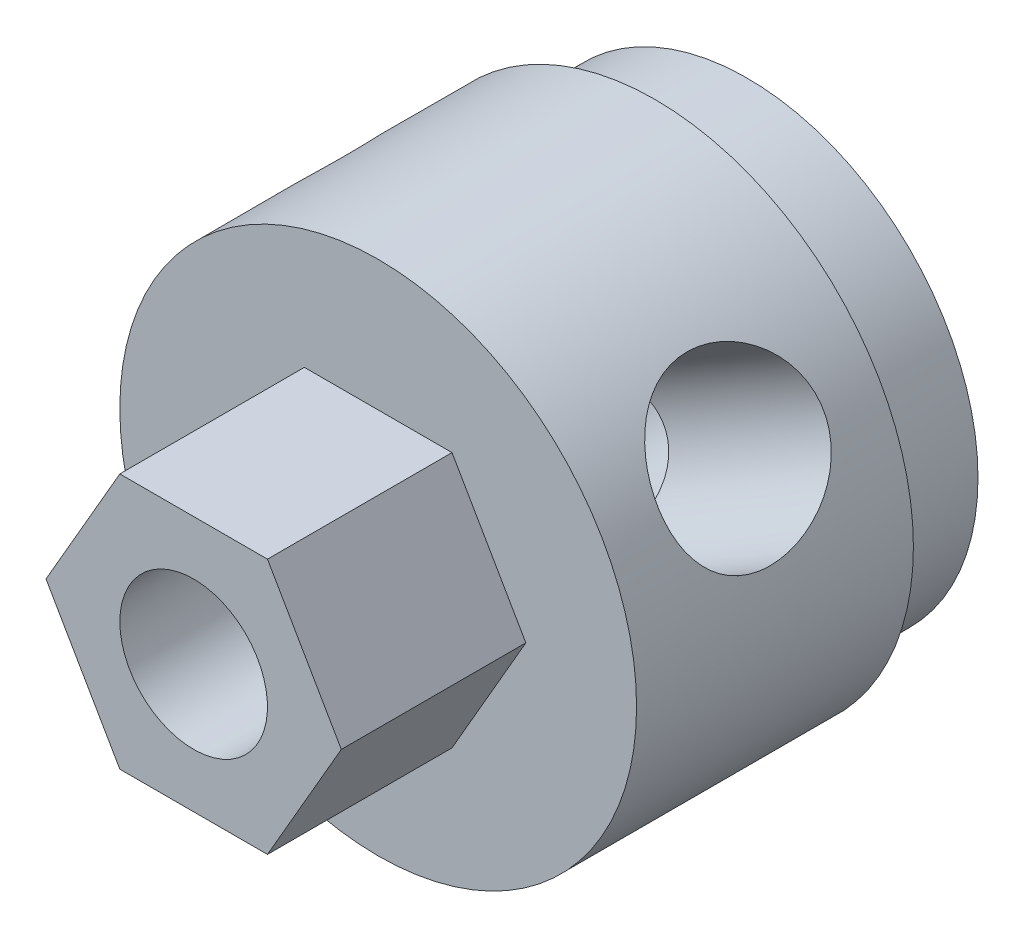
ISO-10303-21;
HEADER;
FILE_DESCRIPTION(('STEP AP214'),'2;1');
FILE_NAME('part.step','',(''),(''),'','','');
FILE_SCHEMA(('AUTOMOTIVE_DESIGN { 1 0 10303 214 1 1 1 1 }'));
ENDSEC;
DATA;
#1=APPLICATION_CONTEXT('core data for automotive mechanical design processes');
#2=APPLICATION_PROTOCOL_DEFINITION('international standard','automotive_design',2000,#1);
#3=PRODUCT_CONTEXT('',#1,'mechanical');
#4=PRODUCT('Part','Part','',(#3));
#5=PRODUCT_RELATED_PRODUCT_CATEGORY('part','',(#4));
#6=PRODUCT_DEFINITION_FORMATION('','',#4);
#7=PRODUCT_DEFINITION_CONTEXT('part definition',#1,'design');
#8=PRODUCT_DEFINITION('design','',#6,#7);
#9=PRODUCT_DEFINITION_SHAPE('','',#8);
#10=(LENGTH_UNIT() NAMED_UNIT(*) SI_UNIT(.MILLI.,.METRE.));
#11=(NAMED_UNIT(*) PLANE_ANGLE_UNIT() SI_UNIT($,.RADIAN.));
#12=(NAMED_UNIT(*) SI_UNIT($,.STERADIAN.) SOLID_ANGLE_UNIT());
#13=UNCERTAINTY_MEASURE_WITH_UNIT(LENGTH_MEASURE(1.E-05),#10,'distance_accuracy_value','');
#14=(GEOMETRIC_REPRESENTATION_CONTEXT(3) GLOBAL_UNCERTAINTY_ASSIGNED_CONTEXT((#13)) GLOBAL_UNIT_ASSIGNED_CONTEXT((#10,
#11,#12)) REPRESENTATION_CONTEXT('',''));
#15=CARTESIAN_POINT('',(0.,0.,0.));
#16=DIRECTION('',(0.,0.,1.));
#17=DIRECTION('',(1.,0.,0.));
#18=AXIS2_PLACEMENT_3D('',#15,#16,#17);
#19=CARTESIAN_POINT('',(0.,0.,7.62));
#20=DIRECTION('',(0.,0.,-1.));
#21=DIRECTION('',(-1.,0.,0.));
#22=AXIS2_PLACEMENT_3D('',#19,#20,#21);
#23=CYLINDRICAL_SURFACE('',#22,1.016);
#24=CARTESIAN_POINT('',(0.,0.,7.62));
#25=DIRECTION('',(0.,0.,-1.));
#26=DIRECTION('',(-1.,0.,0.));
#27=AXIS2_PLACEMENT_3D('',#24,#25,#26);
#28=CIRCLE('',#27,1.016);
#29=CARTESIAN_POINT('',(-1.016,0.,7.62));
#30=VERTEX_POINT('',#29);
#31=EDGE_CURVE('E210',#30,#30,#28,.T.);
#32=ORIENTED_EDGE('',*,*,#31,.F.);
#33=EDGE_LOOP('',(#32));
#34=FACE_BOUND('',#33,.T.);
#35=CARTESIAN_POINT('',(1.016,0.,3.69863441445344));
#36=CARTESIAN_POINT('',(1.01603355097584,-0.0319719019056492,3.69849554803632));
#37=CARTESIAN_POINT('',(1.01449438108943,-0.0636941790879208,3.70156606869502));
#38=CARTESIAN_POINT('',(1.00868366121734,-0.12545036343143,3.71264536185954));
#39=CARTESIAN_POINT('',(1.00446171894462,-0.155504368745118,3.72056438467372));
#40=CARTESIAN_POINT('',(0.991109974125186,-0.227809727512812,3.74456172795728));
#41=CARTESIAN_POINT('',(0.980601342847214,-0.269070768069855,3.76272910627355));
#42=CARTESIAN_POINT('',(0.955258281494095,-0.348563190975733,3.80310135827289));
#43=CARTESIAN_POINT('',(0.940378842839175,-0.386757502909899,3.82534728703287));
#44=CARTESIAN_POINT('',(0.909633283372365,-0.453796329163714,3.86751355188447));
#45=CARTESIAN_POINT('',(0.894395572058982,-0.483107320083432,3.88715953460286));
#46=CARTESIAN_POINT('',(0.861292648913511,-0.53991901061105,3.9268605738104));
#47=CARTESIAN_POINT('',(0.843425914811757,-0.56741864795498,3.94691586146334));
#48=CARTESIAN_POINT('',(0.785987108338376,-0.647119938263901,4.0066911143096));
#49=CARTESIAN_POINT('',(0.74246382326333,-0.69676790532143,4.04618498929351));
#50=CARTESIAN_POINT('',(0.656277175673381,-0.777274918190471,4.11199760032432));
#51=CARTESIAN_POINT('',(0.615848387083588,-0.809799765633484,4.13922227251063));
#52=CARTESIAN_POINT('',(0.528732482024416,-0.869175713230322,4.18959825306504));
#53=CARTESIAN_POINT('',(0.48205417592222,-0.89603466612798,4.21275519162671));
#54=CARTESIAN_POINT('',(0.392482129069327,-0.938173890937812,4.24937341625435));
#55=CARTESIAN_POINT('',(0.350584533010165,-0.954687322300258,4.26384272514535));
#56=CARTESIAN_POINT('',(0.263717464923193,-0.982232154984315,4.28807213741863));
#57=CARTESIAN_POINT('',(0.218750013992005,-0.993267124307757,4.29783530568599));
#58=CARTESIAN_POINT('',(0.126614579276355,-1.00916822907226,4.31192559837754));
#59=CARTESIAN_POINT('',(0.0794355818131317,-1.01399909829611,4.31622164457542));
#60=CARTESIAN_POINT('',(-0.0152982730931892,-1.01698844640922,4.31887844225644));
#61=CARTESIAN_POINT('',(-0.0628530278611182,-1.01514868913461,4.31724076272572));
#62=CARTESIAN_POINT('',(-0.152358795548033,-1.00542691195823,4.30861020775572));
#63=CARTESIAN_POINT('',(-0.194423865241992,-0.99811428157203,4.30212203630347));
#64=CARTESIAN_POINT('',(-0.276465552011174,-0.978571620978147,4.28485341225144));
#65=CARTESIAN_POINT('',(-0.316441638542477,-0.966340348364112,4.27407187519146));
#66=CARTESIAN_POINT('',(-0.395938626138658,-0.936695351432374,4.24809677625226));
#67=CARTESIAN_POINT('',(-0.435281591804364,-0.919010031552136,4.23267337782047));
#68=CARTESIAN_POINT('',(-0.510310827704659,-0.879566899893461,4.19858849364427));
#69=CARTESIAN_POINT('',(-0.545996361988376,-0.857808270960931,4.17992635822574));
#70=CARTESIAN_POINT('',(-0.631200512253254,-0.798601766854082,4.12977234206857));
#71=CARTESIAN_POINT('',(-0.678211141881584,-0.758894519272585,4.09666992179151));
#72=CARTESIAN_POINT('',(-0.763523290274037,-0.673036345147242,4.02736445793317));
#73=CARTESIAN_POINT('',(-0.801783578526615,-0.626856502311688,3.99114779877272));
#74=CARTESIAN_POINT('',(-0.870476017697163,-0.527515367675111,3.91748746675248));
#75=CARTESIAN_POINT('',(-0.900698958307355,-0.474213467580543,3.88003516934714));
#76=CARTESIAN_POINT('',(-0.938974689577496,-0.389275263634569,3.8271159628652));
#77=CARTESIAN_POINT('',(-0.95054156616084,-0.360191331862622,3.81004865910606));
#78=CARTESIAN_POINT('',(-0.971191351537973,-0.300086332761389,3.77798954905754));
#79=CARTESIAN_POINT('',(-0.98027884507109,-0.269068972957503,3.76299393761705));
#80=CARTESIAN_POINT('',(-0.994722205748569,-0.208855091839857,3.73816655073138));
#81=CARTESIAN_POINT('',(-1.00040134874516,-0.179910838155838,3.72792475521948));
#82=CARTESIAN_POINT('',(-1.00925776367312,-0.12057939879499,3.71160091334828));
#83=CARTESIAN_POINT('',(-1.01244765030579,-0.0902003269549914,3.70549791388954));
#84=CARTESIAN_POINT('',(-1.01541963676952,-0.0397517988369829,3.69975662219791));
#85=CARTESIAN_POINT('',(-1.01601358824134,-0.0198920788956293,3.69858485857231));
#86=CARTESIAN_POINT('',(-1.016,0.,3.69863441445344));
#87=B_SPLINE_CURVE_WITH_KNOTS('',3,(#35,#36,#37,#38,#39,#40,#41,#42,#43,#44,#45,#46,#47,#48,#49,
#50,#51,#52,#53,#54,#55,#56,#57,#58,#59,#60,#61,#62,#63,#64,#65,#66,#67,#68,#69,#70,#71,#72,#73,
#74,#75,#76,#77,#78,#79,#80,#81,#82,#83,#84,#85,#86),.UNSPECIFIED.,.F.,.F.,(4,2,2,2,2,2,2,2,2,2,
2,2,2,2,2,2,2,2,2,2,2,2,2,2,2,4),(0.,0.0953376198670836,0.188961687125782,0.327075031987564,
0.466663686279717,0.581823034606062,0.697049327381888,0.926567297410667,1.10176251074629,
1.27671329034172,1.41804838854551,1.55929131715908,1.70133361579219,1.84333835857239,
1.97232474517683,2.10134373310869,2.23826712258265,2.37521801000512,2.58368717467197,
2.79311926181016,3.00756248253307,3.11438073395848,3.22100010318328,3.31437819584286,
3.40727995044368,3.46686552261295),.UNSPECIFIED.);
#88=CARTESIAN_POINT('',(0.879881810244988,-0.508000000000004,3.90455945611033));
#89=VERTEX_POINT('',#88);
#90=CARTESIAN_POINT('',(-0.879881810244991,-0.507999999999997,3.90455945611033));
#91=VERTEX_POINT('',#90);
#92=EDGE_CURVE('E173',#89,#91,#87,.T.);
#93=ORIENTED_EDGE('',*,*,#92,.T.);
#94=CARTESIAN_POINT('',(-1.016,0.,4.19890673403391));
#95=CARTESIAN_POINT('',(-1.01599894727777,0.0436966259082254,4.21768094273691));
#96=CARTESIAN_POINT('',(-1.01317759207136,0.0881238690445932,4.23485067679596));
#97=CARTESIAN_POINT('',(-1.00136965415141,0.177626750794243,4.26500277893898));
#98=CARTESIAN_POINT('',(-0.992381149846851,0.222702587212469,4.27798384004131));
#99=CARTESIAN_POINT('',(-0.967836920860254,0.312618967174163,4.2989011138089));
#100=CARTESIAN_POINT('',(-0.952237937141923,0.357455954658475,4.30680321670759));
#101=CARTESIAN_POINT('',(-0.914594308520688,0.445016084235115,4.31672603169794));
#102=CARTESIAN_POINT('',(-0.892554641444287,0.487740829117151,4.31875127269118));
#103=CARTESIAN_POINT('',(-0.844840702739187,0.566060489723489,4.31683020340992));
#104=CARTESIAN_POINT('',(-0.819631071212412,0.60195280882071,4.31337414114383));
#105=CARTESIAN_POINT('',(-0.76525549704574,0.669722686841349,4.30166482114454));
#106=CARTESIAN_POINT('',(-0.736088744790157,0.701599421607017,4.29341058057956));
#107=CARTESIAN_POINT('',(-0.674635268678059,0.760892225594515,4.27263512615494));
#108=CARTESIAN_POINT('',(-0.642334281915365,0.788286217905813,4.26009368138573));
#109=CARTESIAN_POINT('',(-0.575640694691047,0.838231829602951,4.23149598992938));
#110=CARTESIAN_POINT('',(-0.54124719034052,0.860781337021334,4.21543821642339));
#111=CARTESIAN_POINT('',(-0.454614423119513,0.91055839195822,4.17236444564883));
#112=CARTESIAN_POINT('',(-0.401576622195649,0.935013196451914,4.14374280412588));
#113=CARTESIAN_POINT('',(-0.294039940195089,0.974212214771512,4.08272404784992));
#114=CARTESIAN_POINT('',(-0.239537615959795,0.98893099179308,4.05031730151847));
#115=CARTESIAN_POINT('',(-0.128691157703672,1.00942661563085,3.98315866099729));
#116=CARTESIAN_POINT('',(-0.0723326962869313,1.01500294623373,3.94837118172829));
#117=CARTESIAN_POINT('',(0.0410159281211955,1.01675570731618,3.87967552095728));
#118=CARTESIAN_POINT('',(0.0980046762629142,1.01295010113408,3.84576578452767));
#119=CARTESIAN_POINT('',(0.186152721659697,0.999274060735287,3.79804349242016));
#120=CARTESIAN_POINT('',(0.216834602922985,0.993104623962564,3.78228800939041));
#121=CARTESIAN_POINT('',(0.278689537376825,0.977550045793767,3.75351140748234));
#122=CARTESIAN_POINT('',(0.309861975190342,0.968168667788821,3.74048711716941));
#123=CARTESIAN_POINT('',(0.367020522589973,0.947787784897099,3.72080117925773));
#124=CARTESIAN_POINT('',(0.392955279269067,0.937362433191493,3.71342359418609));
#125=CARTESIAN_POINT('',(0.444532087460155,0.914025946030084,3.70284826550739));
#126=CARTESIAN_POINT('',(0.470174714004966,0.901121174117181,3.69963998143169));
#127=CARTESIAN_POINT('',(0.520501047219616,0.873022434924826,3.69803365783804));
#128=CARTESIAN_POINT('',(0.545179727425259,0.857818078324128,3.69965810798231));
#129=CARTESIAN_POINT('',(0.592679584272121,0.825719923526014,3.70741623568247));
#130=CARTESIAN_POINT('',(0.615496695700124,0.808822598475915,3.71355950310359));
#131=CARTESIAN_POINT('',(0.668330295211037,0.766283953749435,3.73270203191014));
#132=CARTESIAN_POINT('',(0.697169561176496,0.740032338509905,3.74752015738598));
#133=CARTESIAN_POINT('',(0.750602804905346,0.685793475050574,3.78118211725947));
#134=CARTESIAN_POINT('',(0.775178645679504,0.657799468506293,3.8000424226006));
#135=CARTESIAN_POINT('',(0.817984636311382,0.603498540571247,3.83753981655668));
#136=CARTESIAN_POINT('',(0.836617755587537,0.577356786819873,3.85596273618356));
#137=CARTESIAN_POINT('',(0.87114013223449,0.523818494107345,3.89355519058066));
#138=CARTESIAN_POINT('',(0.887027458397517,0.496421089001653,3.91272523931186));
#139=CARTESIAN_POINT('',(0.93072434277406,0.412317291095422,3.97040229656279));
#140=CARTESIAN_POINT('',(0.954615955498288,0.353638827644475,4.00912132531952));
#141=CARTESIAN_POINT('',(0.98846513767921,0.240976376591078,4.07760412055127));
#142=CARTESIAN_POINT('',(1.00003985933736,0.187741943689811,4.10780988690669));
#143=CARTESIAN_POINT('',(1.01449516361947,0.0781014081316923,4.16427313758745));
#144=CARTESIAN_POINT('',(1.01739338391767,0.0217019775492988,4.19053852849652));
#145=CARTESIAN_POINT('',(1.01379300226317,-0.0805696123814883,4.23201263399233));
#146=CARTESIAN_POINT('',(1.00921766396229,-0.126034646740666,4.24838279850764));
#147=CARTESIAN_POINT('',(0.993566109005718,-0.217303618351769,4.2764979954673));
#148=CARTESIAN_POINT('',(0.982493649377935,-0.263107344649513,4.28824569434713));
#149=CARTESIAN_POINT('',(0.953526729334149,-0.354022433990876,4.30626353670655));
#150=CARTESIAN_POINT('',(0.935586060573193,-0.399126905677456,4.31249561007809));
#151=CARTESIAN_POINT('',(0.893200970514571,-0.486628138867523,4.31875330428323));
#152=CARTESIAN_POINT('',(0.86875980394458,-0.529026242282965,4.31878202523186));
#153=CARTESIAN_POINT('',(0.817296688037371,-0.605109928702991,4.31298417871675));
#154=CARTESIAN_POINT('',(0.790853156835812,-0.639240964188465,4.30780045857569));
#155=CARTESIAN_POINT('',(0.734439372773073,-0.703333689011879,4.29292164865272));
#156=CARTESIAN_POINT('',(0.704468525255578,-0.73329467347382,4.28322579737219));
#157=CARTESIAN_POINT('',(0.640828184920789,-0.789598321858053,4.25953583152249));
#158=CARTESIAN_POINT('',(0.607065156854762,-0.815774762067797,4.24540133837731));
#159=CARTESIAN_POINT('',(0.53767141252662,-0.863094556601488,4.21377413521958));
#160=CARTESIAN_POINT('',(0.502039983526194,-0.884235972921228,4.19628013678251));
#161=CARTESIAN_POINT('',(0.411373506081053,-0.931010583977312,4.14926229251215));
#162=CARTESIAN_POINT('',(0.355585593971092,-0.953562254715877,4.1181108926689));
#163=CARTESIAN_POINT('',(0.242716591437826,-0.988359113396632,4.05238557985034));
#164=CARTESIAN_POINT('',(0.185631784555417,-1.00056940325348,4.01780051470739));
#165=CARTESIAN_POINT('',(0.0694922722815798,-1.01535167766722,3.94681288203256));
#166=CARTESIAN_POINT('',(0.0104223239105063,-1.01769763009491,3.91038685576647));
#167=CARTESIAN_POINT('',(-0.0787947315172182,-1.01337373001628,3.8576786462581));
#168=CARTESIAN_POINT('',(-0.10860702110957,-1.01063163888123,3.84044658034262));
#169=CARTESIAN_POINT('',(-0.168579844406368,-1.00237393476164,3.80732865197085));
#170=CARTESIAN_POINT('',(-0.198739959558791,-0.996861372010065,3.79144133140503));
#171=CARTESIAN_POINT('',(-0.25711994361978,-0.983346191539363,3.76320404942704));
#172=CARTESIAN_POINT('',(-0.285303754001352,-0.97557600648,3.75067339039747));
#173=CARTESIAN_POINT('',(-0.341977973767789,-0.957178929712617,3.72884672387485));
#174=CARTESIAN_POINT('',(-0.370467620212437,-0.946558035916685,3.71954401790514));
#175=CARTESIAN_POINT('',(-0.427835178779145,-0.92206089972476,3.70553789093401));
#176=CARTESIAN_POINT('',(-0.456711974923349,-0.908135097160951,3.70091076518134));
#177=CARTESIAN_POINT('',(-0.513244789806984,-0.877420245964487,3.69768673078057));
#178=CARTESIAN_POINT('',(-0.540902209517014,-0.860634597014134,3.69908270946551));
#179=CARTESIAN_POINT('',(-0.58965597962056,-0.827821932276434,3.70682412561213));
#180=CARTESIAN_POINT('',(-0.611098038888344,-0.812095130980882,3.71235146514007));
#181=CARTESIAN_POINT('',(-0.652072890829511,-0.7795779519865,3.72651792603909));
#182=CARTESIAN_POINT('',(-0.671602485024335,-0.762785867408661,3.73516215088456));
#183=CARTESIAN_POINT('',(-0.725939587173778,-0.712496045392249,3.76363092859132));
#184=CARTESIAN_POINT('',(-0.758167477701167,-0.677914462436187,3.78640068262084));
#185=CARTESIAN_POINT('',(-0.816642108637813,-0.606219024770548,3.83549051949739));
#186=CARTESIAN_POINT('',(-0.842859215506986,-0.569093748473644,3.86182721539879));
#187=CARTESIAN_POINT('',(-0.90085964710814,-0.474415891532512,3.92810906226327));
#188=CARTESIAN_POINT('',(-0.929559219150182,-0.41539446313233,3.96868561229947));
#189=CARTESIAN_POINT('',(-0.975371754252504,-0.291897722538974,4.04762038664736));
#190=CARTESIAN_POINT('',(-0.992531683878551,-0.227445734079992,4.08598701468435));
#191=CARTESIAN_POINT('',(-1.00740376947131,-0.134491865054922,4.13543954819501));
#192=CARTESIAN_POINT('',(-1.01059311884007,-0.108064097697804,4.14888081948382));
#193=CARTESIAN_POINT('',(-1.01489209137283,-0.0545202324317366,4.17472767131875));
#194=CARTESIAN_POINT('',(-1.01600066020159,-0.027403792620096,4.18713272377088));
#195=CARTESIAN_POINT('',(-1.016,0.,4.19890673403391));
#196=B_SPLINE_CURVE_WITH_KNOTS('',3,(#94,#95,#96,#97,#98,#99,#100,#101,#102,#103,#104,#105,#106,
#107,#108,#109,#110,#111,#112,#113,#114,#115,#116,#117,#118,#119,#120,#121,#122,#123,#124,#125,
#126,#127,#128,#129,#130,#131,#132,#133,#134,#135,#136,#137,#138,#139,#140,#141,#142,#143,#144,
#145,#146,#147,#148,#149,#150,#151,#152,#153,#154,#155,#156,#157,#158,#159,#160,#161,#162,#163,
#164,#165,#166,#167,#168,#169,#170,#171,#172,#173,#174,#175,#176,#177,#178,#179,#180,#181,#182,
#183,#184,#185,#186,#187,#188,#189,#190,#191,#192,#193,#194,#195),.UNSPECIFIED.,.T.,.F.,(4,2,2,
2,2,2,2,2,2,2,2,2,2,2,2,2,2,2,2,2,2,2,2,2,2,2,2,2,2,2,2,2,2,2,2,2,2,2,2,2,2,2,2,2,2,2,2,2,2,2,
4),(0.,0.142593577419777,0.285231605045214,0.4288178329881,0.57229337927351,0.703642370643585,
0.835018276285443,0.967022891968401,1.09908493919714,1.29313802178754,1.48769611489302,
1.68646688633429,1.88485737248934,1.98980133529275,2.09462275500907,2.18102192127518,
2.26720223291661,2.35378422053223,2.44055048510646,2.56500090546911,2.68996841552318,
2.80085906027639,2.91182738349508,3.13349998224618,3.31972855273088,3.50557829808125,
3.6506272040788,3.79559231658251,3.94155037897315,4.08743549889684,4.21729537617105,
4.3471771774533,4.48167012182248,4.61621474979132,4.81837048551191,5.0212057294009,
5.22866425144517,5.33219602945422,5.43561406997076,5.5308216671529,5.62583049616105,
5.7223657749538,5.81878708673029,5.8999517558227,5.98124992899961,6.13775545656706,
6.29501672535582,6.52543164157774,6.75490299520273,6.84428349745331,6.93370927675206),.UNSPECIFIED.);
#197=CARTESIAN_POINT('',(0.,1.016,3.90455945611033));
#198=VERTEX_POINT('',#197);
#199=EDGE_CURVE('E112',#91,#198,#196,.T.);
#200=ORIENTED_EDGE('',*,*,#199,.T.);
#201=CARTESIAN_POINT('',(-1.016,0.,4.19890673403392));
#202=CARTESIAN_POINT('',(-1.01599817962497,0.0633777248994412,4.17167253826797));
#203=CARTESIAN_POINT('',(-1.01005758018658,0.125392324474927,4.14097704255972));
#204=CARTESIAN_POINT('',(-0.987828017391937,0.245387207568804,4.07537539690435));
#205=CARTESIAN_POINT('',(-0.971482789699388,0.303343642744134,4.0404471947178));
#206=CARTESIAN_POINT('',(-0.929571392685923,0.414303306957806,3.96922919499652));
#207=CARTESIAN_POINT('',(-0.904071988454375,0.467338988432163,3.93295091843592));
#208=CARTESIAN_POINT('',(-0.858919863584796,0.543486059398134,3.87979563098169));
#209=CARTESIAN_POINT('',(-0.842738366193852,0.568277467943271,3.86230450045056));
#210=CARTESIAN_POINT('',(-0.807912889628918,0.616785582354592,3.82832898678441));
#211=CARTESIAN_POINT('',(-0.789270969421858,0.640503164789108,3.81184377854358));
#212=CARTESIAN_POINT('',(-0.749911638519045,0.686124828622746,3.78122188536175));
#213=CARTESIAN_POINT('',(-0.72927975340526,0.708062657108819,3.76702692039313));
#214=CARTESIAN_POINT('',(-0.68520222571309,0.750794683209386,3.74156725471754));
#215=CARTESIAN_POINT('',(-0.661761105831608,0.771590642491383,3.73029793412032));
#216=CARTESIAN_POINT('',(-0.615897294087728,0.808485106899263,3.7137249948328));
#217=CARTESIAN_POINT('',(-0.593902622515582,0.824805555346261,3.70775871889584));
#218=CARTESIAN_POINT('',(-0.548161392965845,0.855882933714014,3.70001597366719));
#219=CARTESIAN_POINT('',(-0.524418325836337,0.870642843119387,3.69823137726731));
#220=CARTESIAN_POINT('',(-0.47582764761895,0.89812282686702,3.69919461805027));
#221=CARTESIAN_POINT('',(-0.450978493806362,0.910839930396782,3.70194899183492));
#222=CARTESIAN_POINT('',(-0.400951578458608,0.933947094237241,3.71146499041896));
#223=CARTESIAN_POINT('',(-0.375773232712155,0.944332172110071,3.71823508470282));
#224=CARTESIAN_POINT('',(-0.311310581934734,0.968041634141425,3.73946345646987));
#225=CARTESIAN_POINT('',(-0.272148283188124,0.97967831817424,3.75610442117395));
#226=CARTESIAN_POINT('',(-0.1945081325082,0.998011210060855,3.79333541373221));
#227=CARTESIAN_POINT('',(-0.156033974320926,1.00468582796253,3.81394221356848));
#228=CARTESIAN_POINT('',(-0.0849782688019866,1.01297803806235,3.85398385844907));
#229=CARTESIAN_POINT('',(-0.0523253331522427,1.01517245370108,3.87317937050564));
#230=CARTESIAN_POINT('',(0.0127123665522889,1.01644139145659,3.91213118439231));
#231=CARTESIAN_POINT('',(0.0450969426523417,1.01551388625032,3.93188784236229));
#232=CARTESIAN_POINT('',(0.141892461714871,1.00812340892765,3.99105096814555));
#233=CARTESIAN_POINT('',(0.206063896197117,0.997065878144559,4.03042259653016));
#234=CARTESIAN_POINT('',(0.319825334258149,0.965752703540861,4.09756686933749));
#235=CARTESIAN_POINT('',(0.369666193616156,0.947895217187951,4.12604644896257));
#236=CARTESIAN_POINT('',(0.467634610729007,0.903577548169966,4.17897560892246));
#237=CARTESIAN_POINT('',(0.515765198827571,0.877133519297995,4.20343262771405));
#238=CARTESIAN_POINT('',(0.599350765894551,0.82159240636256,4.24210697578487));
#239=CARTESIAN_POINT('',(0.635392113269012,0.794130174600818,4.25739525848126));
#240=CARTESIAN_POINT('',(0.704373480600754,0.733630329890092,4.28329645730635));
#241=CARTESIAN_POINT('',(0.737315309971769,0.700596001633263,4.29391211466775));
#242=CARTESIAN_POINT('',(0.799052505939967,0.629290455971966,4.30968492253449));
#243=CARTESIAN_POINT('',(0.827821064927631,0.590988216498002,4.31480802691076));
#244=CARTESIAN_POINT('',(0.879760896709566,0.510459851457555,4.31899971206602));
#245=CARTESIAN_POINT('',(0.902934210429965,0.468235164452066,4.31807050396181));
#246=CARTESIAN_POINT('',(0.940902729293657,0.385761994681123,4.31065096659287));
#247=CARTESIAN_POINT('',(0.956303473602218,0.345737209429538,4.30472521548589));
#248=CARTESIAN_POINT('',(0.981773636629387,0.264902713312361,4.28848947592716));
#249=CARTESIAN_POINT('',(0.991841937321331,0.224092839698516,4.27817856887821));
#250=CARTESIAN_POINT('',(1.00716090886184,0.140620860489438,4.25320238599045));
#251=CARTESIAN_POINT('',(1.01214433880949,0.0979686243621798,4.23834449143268));
#252=CARTESIAN_POINT('',(1.01678536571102,0.0136927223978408,4.20533804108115));
#253=CARTESIAN_POINT('',(1.01644130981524,-0.0279306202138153,4.18718846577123));
#254=CARTESIAN_POINT('',(1.00946783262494,-0.130691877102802,4.13839985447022));
#255=CARTESIAN_POINT('',(0.999696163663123,-0.190853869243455,4.10613885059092));
#256=CARTESIAN_POINT('',(0.970378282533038,-0.306972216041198,4.03837122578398));
#257=CARTESIAN_POINT('',(0.95079364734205,-0.3629110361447,4.00285229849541));
#258=CARTESIAN_POINT('',(0.901951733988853,-0.471571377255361,3.93031276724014));
#259=CARTESIAN_POINT('',(0.872478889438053,-0.524187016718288,3.89327647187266));
#260=CARTESIAN_POINT('',(0.820767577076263,-0.59959633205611,3.84034990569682));
#261=CARTESIAN_POINT('',(0.802311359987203,-0.624115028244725,3.82316804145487));
#262=CARTESIAN_POINT('',(0.762637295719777,-0.672017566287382,3.79052920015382));
#263=CARTESIAN_POINT('',(0.741423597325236,-0.695403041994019,3.77506969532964));
#264=CARTESIAN_POINT('',(0.698711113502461,-0.738142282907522,3.74885769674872));
#265=CARTESIAN_POINT('',(0.677571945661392,-0.757637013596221,3.73775954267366));
#266=CARTESIAN_POINT('',(0.632816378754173,-0.795394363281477,3.71911028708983));
#267=CARTESIAN_POINT('',(0.609207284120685,-0.813660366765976,3.7115490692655));
#268=CARTESIAN_POINT('',(0.55935522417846,-0.848713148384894,3.70121489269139));
#269=CARTESIAN_POINT('',(0.533080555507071,-0.865476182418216,3.69850907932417));
#270=CARTESIAN_POINT('',(0.479108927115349,-0.896481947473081,3.6987689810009));
#271=CARTESIAN_POINT('',(0.451411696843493,-0.910724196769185,3.70173577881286));
#272=CARTESIAN_POINT('',(0.392503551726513,-0.937746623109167,3.71323154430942));
#273=CARTESIAN_POINT('',(0.361254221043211,-0.950171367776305,3.72235983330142));
#274=CARTESIAN_POINT('',(0.29904526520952,-0.971554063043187,3.74483023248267));
#275=CARTESIAN_POINT('',(0.268087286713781,-0.980498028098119,3.75818895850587));
#276=CARTESIAN_POINT('',(0.182131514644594,-1.00116139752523,3.79904437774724));
#277=CARTESIAN_POINT('',(0.127652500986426,-1.0094053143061,3.82931956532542));
#278=CARTESIAN_POINT('',(0.0195684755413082,-1.01725449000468,3.89234798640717));
#279=CARTESIAN_POINT('',(-0.03403452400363,-1.01684207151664,3.92510615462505));
#280=CARTESIAN_POINT('',(-0.145640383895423,-1.00720453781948,3.99336972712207));
#281=CARTESIAN_POINT('',(-0.203593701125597,-0.997171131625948,4.02885023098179));
#282=CARTESIAN_POINT('',(-0.318413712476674,-0.966634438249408,4.09683406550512));
#283=CARTESIAN_POINT('',(-0.375282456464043,-0.946153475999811,4.12934357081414));
#284=CARTESIAN_POINT('',(-0.473438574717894,-0.90017054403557,4.18185450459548));
#285=CARTESIAN_POINT('',(-0.515214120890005,-0.877022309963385,4.20299166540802));
#286=CARTESIAN_POINT('',(-0.596422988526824,-0.8239441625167,4.2409107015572));
#287=CARTESIAN_POINT('',(-0.635857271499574,-0.794017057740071,4.25769437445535));
#288=CARTESIAN_POINT('',(-0.711360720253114,-0.727175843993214,4.28578231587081));
#289=CARTESIAN_POINT('',(-0.747393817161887,-0.690197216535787,4.29703225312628));
#290=CARTESIAN_POINT('',(-0.813928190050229,-0.610301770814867,4.31269202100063));
#291=CARTESIAN_POINT('',(-0.84443647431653,-0.567392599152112,4.31711057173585));
#292=CARTESIAN_POINT('',(-0.894472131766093,-0.483929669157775,4.31853397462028));
#293=CARTESIAN_POINT('',(-0.914954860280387,-0.443959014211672,4.31653442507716));
#294=CARTESIAN_POINT('',(-0.950308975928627,-0.362151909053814,4.30740415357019));
#295=CARTESIAN_POINT('',(-0.965177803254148,-0.320314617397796,4.30027109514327));
#296=CARTESIAN_POINT('',(-0.988840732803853,-0.237212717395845,4.28167576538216));
#297=CARTESIAN_POINT('',(-0.997788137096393,-0.195963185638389,4.27033569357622));
#298=CARTESIAN_POINT('',(-1.01044830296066,-0.113892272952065,4.24401880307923));
#299=CARTESIAN_POINT('',(-1.0141680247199,-0.0730703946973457,4.22904685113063));
#300=CARTESIAN_POINT('',(-1.01582506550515,-0.0218340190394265,4.2081694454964));
#301=CARTESIAN_POINT('',(-1.01600031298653,-0.010896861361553,4.20358925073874));
#302=CARTESIAN_POINT('',(-1.016,0.,4.19890673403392));
#303=B_SPLINE_CURVE_WITH_KNOTS('',3,(#201,#202,#203,#204,#205,#206,#207,#208,#209,#210,#211,
#212,#213,#214,#215,#216,#217,#218,#219,#220,#221,#222,#223,#224,#225,#226,#227,#228,#229,#230,
#231,#232,#233,#234,#235,#236,#237,#238,#239,#240,#241,#242,#243,#244,#245,#246,#247,#248,#249,
#250,#251,#252,#253,#254,#255,#256,#257,#258,#259,#260,#261,#262,#263,#264,#265,#266,#267,#268,
#269,#270,#271,#272,#273,#274,#275,#276,#277,#278,#279,#280,#281,#282,#283,#284,#285,#286,#287,
#288,#289,#290,#291,#292,#293,#294,#295,#296,#297,#298,#299,#300,#301,#302),.UNSPECIFIED.,.T.,
.F.,(4,2,2,2,2,2,2,2,2,2,2,2,2,2,2,2,2,2,2,2,2,2,2,2,2,2,2,2,2,2,2,2,2,2,2,2,2,2,2,2,2,2,2,2,2,
2,2,2,2,2,4),(0.,0.206917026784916,0.414962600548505,0.621520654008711,0.72459274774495,
0.827579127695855,0.927269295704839,1.02680107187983,1.11054856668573,1.1941331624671,
1.27783823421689,1.36172047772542,1.49331170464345,1.62547218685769,1.73914419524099,
1.85289003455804,2.07996786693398,2.25970564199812,2.43910721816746,2.58200259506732,
2.72481402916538,2.86850566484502,3.01214480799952,3.14144068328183,3.27076365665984,
3.40657916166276,3.54243680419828,3.74818180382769,3.95473877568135,4.16612800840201,
4.27152633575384,4.37676788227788,4.46899586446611,4.56095841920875,4.65418320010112,
4.74742577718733,4.85137038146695,4.95572841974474,5.14331637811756,5.33128745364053,
5.53657367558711,5.74142305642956,5.8975375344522,6.05358744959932,6.21114034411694,
6.36849195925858,6.50268032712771,6.63692980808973,6.76755139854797,6.8979989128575,
6.93357523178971),.UNSPECIFIED.);
#304=EDGE_CURVE('E117',#198,#89,#303,.T.);
#305=ORIENTED_EDGE('',*,*,#304,.T.);
#306=EDGE_LOOP('',(#93,#200,#305));
#307=FACE_BOUND('',#306,.T.);
#308=ADVANCED_FACE('F33',(#34,#307),#23,.F.);
#309=CARTESIAN_POINT('',(0.,0.,5.08));
#310=DIRECTION('',(0.,0.,1.));
#311=DIRECTION('',(1.,0.,0.));
#312=AXIS2_PLACEMENT_3D('',#309,#310,#311);
#313=PLANE('',#312);
#314=DIRECTION('',(0.5,0.866025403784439,0.));
#315=VECTOR('',#314,1.);
#316=CARTESIAN_POINT('',(1.016,-1.75976362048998,5.08));
#317=LINE('',#316,#315);
#318=CARTESIAN_POINT('',(1.016,-1.75976362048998,5.08));
#319=VERTEX_POINT('',#318);
#320=CARTESIAN_POINT('',(2.032,0.,5.08));
#321=VERTEX_POINT('',#320);
#322=EDGE_CURVE('E56',#319,#321,#317,.T.);
#323=ORIENTED_EDGE('',*,*,#322,.F.);
#324=DIRECTION('',(1.,0.,0.));
#325=VECTOR('',#324,1.);
#326=CARTESIAN_POINT('',(-1.016,-1.75976362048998,5.08));
#327=LINE('',#326,#325);
#328=CARTESIAN_POINT('',(-1.016,-1.75976362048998,5.08));
#329=VERTEX_POINT('',#328);
#330=EDGE_CURVE('E226',#329,#319,#327,.T.);
#331=ORIENTED_EDGE('',*,*,#330,.F.);
#332=DIRECTION('',(0.5,-0.866025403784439,0.));
#333=VECTOR('',#332,1.);
#334=CARTESIAN_POINT('',(-2.032,0.,5.08));
#335=LINE('',#334,#333);
#336=CARTESIAN_POINT('',(-2.032,0.,5.08));
#337=VERTEX_POINT('',#336);
#338=EDGE_CURVE('E247',#337,#329,#335,.T.);
#339=ORIENTED_EDGE('',*,*,#338,.F.);
#340=DIRECTION('',(-0.5,-0.866025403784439,0.));
#341=VECTOR('',#340,1.);
#342=CARTESIAN_POINT('',(-1.016,1.75976362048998,5.08));
#343=LINE('',#342,#341);
#344=CARTESIAN_POINT('',(-1.016,1.75976362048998,5.08));
#345=VERTEX_POINT('',#344);
#346=EDGE_CURVE('E244',#345,#337,#343,.T.);
#347=ORIENTED_EDGE('',*,*,#346,.F.);
#348=DIRECTION('',(-1.,0.,0.));
#349=VECTOR('',#348,1.);
#350=CARTESIAN_POINT('',(1.016,1.75976362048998,5.08));
#351=LINE('',#350,#349);
#352=CARTESIAN_POINT('',(1.016,1.75976362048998,5.08));
#353=VERTEX_POINT('',#352);
#354=EDGE_CURVE('E241',#353,#345,#351,.T.);
#355=ORIENTED_EDGE('',*,*,#354,.F.);
#356=DIRECTION('',(-0.5,0.866025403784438,0.));
#357=VECTOR('',#356,1.);
#358=CARTESIAN_POINT('',(2.032,0.,5.08));
#359=LINE('',#358,#357);
#360=EDGE_CURVE('E238',#321,#353,#359,.T.);
#361=ORIENTED_EDGE('',*,*,#360,.F.);
#362=EDGE_LOOP('',(#323,#331,#339,#347,#355,#361));
#363=FACE_BOUND('',#362,.T.);
#364=CARTESIAN_POINT('',(0.,0.,5.08));
#365=DIRECTION('',(0.,0.,1.));
#366=DIRECTION('',(1.,0.,0.));
#367=AXIS2_PLACEMENT_3D('',#364,#365,#366);
#368=CIRCLE('',#367,3.556);
#369=CARTESIAN_POINT('',(3.556,0.,5.08));
#370=VERTEX_POINT('',#369);
#371=EDGE_CURVE('E212',#370,#370,#368,.T.);
#372=ORIENTED_EDGE('',*,*,#371,.T.);
#373=EDGE_LOOP('',(#372));
#374=FACE_BOUND('',#373,.T.);
#375=ADVANCED_FACE('F201',(#363,#374),#313,.T.);
#376=CARTESIAN_POINT('',(1.016,-1.75976362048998,7.62));
#377=DIRECTION('',(-0.866025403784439,0.5,0.));
#378=DIRECTION('',(-0.5,-0.866025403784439,0.));
#379=AXIS2_PLACEMENT_3D('',#376,#377,#378);
#380=PLANE('',#379);
#381=ORIENTED_EDGE('',*,*,#322,.T.);
#382=DIRECTION('',(0.,0.,-1.));
#383=VECTOR('',#382,1.);
#384=CARTESIAN_POINT('',(2.032,0.,7.62));
#385=LINE('',#384,#383);
#386=CARTESIAN_POINT('',(2.032,0.,7.62));
#387=VERTEX_POINT('',#386);
#388=EDGE_CURVE('E265',#387,#321,#385,.T.);
#389=ORIENTED_EDGE('',*,*,#388,.F.);
#390=DIRECTION('',(0.5,0.866025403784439,0.));
#391=VECTOR('',#390,1.);
#392=CARTESIAN_POINT('',(1.016,-1.75976362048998,7.62));
#393=LINE('',#392,#391);
#394=CARTESIAN_POINT('',(1.016,-1.75976362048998,7.62));
#395=VERTEX_POINT('',#394);
#396=EDGE_CURVE('E222',#395,#387,#393,.T.);
#397=ORIENTED_EDGE('',*,*,#396,.F.);
#398=DIRECTION('',(0.,0.,-1.));
#399=VECTOR('',#398,1.);
#400=CARTESIAN_POINT('',(1.016,-1.75976362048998,7.62));
#401=LINE('',#400,#399);
#402=EDGE_CURVE('E236',#395,#319,#401,.T.);
#403=ORIENTED_EDGE('',*,*,#402,.T.);
#404=EDGE_LOOP('',(#381,#389,#397,#403));
#405=FACE_BOUND('',#404,.T.);
#406=ADVANCED_FACE('F206',(#405),#380,.F.);
#407=CARTESIAN_POINT('',(2.032,0.,7.62));
#408=DIRECTION('',(-0.866025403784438,-0.5,0.));
#409=DIRECTION('',(0.5,-0.866025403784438,0.));
#410=AXIS2_PLACEMENT_3D('',#407,#408,#409);
#411=PLANE('',#410);
#412=ORIENTED_EDGE('',*,*,#360,.T.);
#413=DIRECTION('',(0.,0.,-1.));
#414=VECTOR('',#413,1.);
#415=CARTESIAN_POINT('',(1.016,1.75976362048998,7.62));
#416=LINE('',#415,#414);
#417=CARTESIAN_POINT('',(1.016,1.75976362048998,7.62));
#418=VERTEX_POINT('',#417);
#419=EDGE_CURVE('E262',#418,#353,#416,.T.);
#420=ORIENTED_EDGE('',*,*,#419,.F.);
#421=DIRECTION('',(-0.5,0.866025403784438,0.));
#422=VECTOR('',#421,1.);
#423=CARTESIAN_POINT('',(2.032,0.,7.62));
#424=LINE('',#423,#422);
#425=EDGE_CURVE('E225',#387,#418,#424,.T.);
#426=ORIENTED_EDGE('',*,*,#425,.F.);
#427=ORIENTED_EDGE('',*,*,#388,.T.);
#428=EDGE_LOOP('',(#412,#420,#426,#427));
#429=FACE_BOUND('',#428,.T.);
#430=ADVANCED_FACE('F284',(#429),#411,.F.);
#431=CARTESIAN_POINT('',(1.016,1.75976362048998,7.62));
#432=DIRECTION('',(0.,-1.,0.));
#433=DIRECTION('',(0.,0.,-1.));
#434=AXIS2_PLACEMENT_3D('',#431,#432,#433);
#435=PLANE('',#434);
#436=ORIENTED_EDGE('',*,*,#354,.T.);
#437=DIRECTION('',(0.,0.,-1.));
#438=VECTOR('',#437,1.);
#439=CARTESIAN_POINT('',(-1.016,1.75976362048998,7.62));
#440=LINE('',#439,#438);
#441=CARTESIAN_POINT('',(-1.016,1.75976362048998,7.62));
#442=VERTEX_POINT('',#441);
#443=EDGE_CURVE('E259',#442,#345,#440,.T.);
#444=ORIENTED_EDGE('',*,*,#443,.F.);
#445=DIRECTION('',(-1.,0.,0.));
#446=VECTOR('',#445,1.);
#447=CARTESIAN_POINT('',(1.016,1.75976362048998,7.62));
#448=LINE('',#447,#446);
#449=EDGE_CURVE('E228',#418,#442,#448,.T.);
#450=ORIENTED_EDGE('',*,*,#449,.F.);
#451=ORIENTED_EDGE('',*,*,#419,.T.);
#452=EDGE_LOOP('',(#436,#444,#450,#451));
#453=FACE_BOUND('',#452,.T.);
#454=ADVANCED_FACE('F288',(#453),#435,.F.);
#455=CARTESIAN_POINT('',(-1.016,1.75976362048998,7.62));
#456=DIRECTION('',(0.866025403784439,-0.5,0.));
#457=DIRECTION('',(0.5,0.866025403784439,0.));
#458=AXIS2_PLACEMENT_3D('',#455,#456,#457);
#459=PLANE('',#458);
#460=ORIENTED_EDGE('',*,*,#346,.T.);
#461=DIRECTION('',(0.,0.,-1.));
#462=VECTOR('',#461,1.);
#463=CARTESIAN_POINT('',(-2.032,0.,7.62));
#464=LINE('',#463,#462);
#465=CARTESIAN_POINT('',(-2.032,0.,7.62));
#466=VERTEX_POINT('',#465);
#467=EDGE_CURVE('E256',#466,#337,#464,.T.);
#468=ORIENTED_EDGE('',*,*,#467,.F.);
#469=DIRECTION('',(-0.5,-0.866025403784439,0.));
#470=VECTOR('',#469,1.);
#471=CARTESIAN_POINT('',(-1.016,1.75976362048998,7.62));
#472=LINE('',#471,#470);
#473=EDGE_CURVE('E230',#442,#466,#472,.T.);
#474=ORIENTED_EDGE('',*,*,#473,.F.);
#475=ORIENTED_EDGE('',*,*,#443,.T.);
#476=EDGE_LOOP('',(#460,#468,#474,#475));
#477=FACE_BOUND('',#476,.T.);
#478=ADVANCED_FACE('F292',(#477),#459,.F.);
#479=CARTESIAN_POINT('',(-2.032,0.,7.62));
#480=DIRECTION('',(0.866025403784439,0.5,0.));
#481=DIRECTION('',(-0.5,0.866025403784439,0.));
#482=AXIS2_PLACEMENT_3D('',#479,#480,#481);
#483=PLANE('',#482);
#484=ORIENTED_EDGE('',*,*,#338,.T.);
#485=DIRECTION('',(0.,0.,-1.));
#486=VECTOR('',#485,1.);
#487=CARTESIAN_POINT('',(-1.016,-1.75976362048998,7.62));
#488=LINE('',#487,#486);
#489=CARTESIAN_POINT('',(-1.016,-1.75976362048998,7.62));
#490=VERTEX_POINT('',#489);
#491=EDGE_CURVE('E253',#490,#329,#488,.T.);
#492=ORIENTED_EDGE('',*,*,#491,.F.);
#493=DIRECTION('',(0.5,-0.866025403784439,0.));
#494=VECTOR('',#493,1.);
#495=CARTESIAN_POINT('',(-2.032,0.,7.62));
#496=LINE('',#495,#494);
#497=EDGE_CURVE('E232',#466,#490,#496,.T.);
#498=ORIENTED_EDGE('',*,*,#497,.F.);
#499=ORIENTED_EDGE('',*,*,#467,.T.);
#500=EDGE_LOOP('',(#484,#492,#498,#499));
#501=FACE_BOUND('',#500,.T.);
#502=ADVANCED_FACE('F296',(#501),#483,.F.);
#503=CARTESIAN_POINT('',(-1.016,-1.75976362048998,7.62));
#504=DIRECTION('',(0.,1.,0.));
#505=DIRECTION('',(-1.,0.,0.));
#506=AXIS2_PLACEMENT_3D('',#503,#504,#505);
#507=PLANE('',#506);
#508=ORIENTED_EDGE('',*,*,#330,.T.);
#509=ORIENTED_EDGE('',*,*,#402,.F.);
#510=DIRECTION('',(1.,0.,0.));
#511=VECTOR('',#510,1.);
#512=CARTESIAN_POINT('',(-1.016,-1.75976362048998,7.62));
#513=LINE('',#512,#511);
#514=EDGE_CURVE('E234',#490,#395,#513,.T.);
#515=ORIENTED_EDGE('',*,*,#514,.F.);
#516=ORIENTED_EDGE('',*,*,#491,.T.);
#517=EDGE_LOOP('',(#508,#509,#515,#516));
#518=FACE_BOUND('',#517,.T.);
#519=ADVANCED_FACE('F299',(#518),#507,.F.);
#520=CARTESIAN_POINT('',(0.,0.,7.62));
#521=DIRECTION('',(0.,0.,1.));
#522=DIRECTION('',(1.,0.,0.));
#523=AXIS2_PLACEMENT_3D('',#520,#521,#522);
#524=PLANE('',#523);
#525=ORIENTED_EDGE('',*,*,#31,.T.);
#526=EDGE_LOOP('',(#525));
#527=FACE_BOUND('',#526,.T.);
#528=ORIENTED_EDGE('',*,*,#396,.T.);
#529=ORIENTED_EDGE('',*,*,#425,.T.);
#530=ORIENTED_EDGE('',*,*,#449,.T.);
#531=ORIENTED_EDGE('',*,*,#473,.T.);
#532=ORIENTED_EDGE('',*,*,#497,.T.);
#533=ORIENTED_EDGE('',*,*,#514,.T.);
#534=EDGE_LOOP('',(#528,#529,#530,#531,#532,#533));
#535=FACE_BOUND('',#534,.T.);
#536=ADVANCED_FACE('F153',(#527,#535),#524,.T.);
#537=CARTESIAN_POINT('',(0.,0.,1.27));
#538=DIRECTION('',(0.,0.,1.));
#539=DIRECTION('',(1.,0.,0.));
#540=AXIS2_PLACEMENT_3D('',#537,#538,#539);
#541=CYLINDRICAL_SURFACE('',#540,3.556);
#542=CARTESIAN_POINT('',(-2.34466447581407,2.67351538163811,3.175));
#543=CARTESIAN_POINT('',(-2.34466467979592,2.67351534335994,3.11260403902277));
#544=CARTESIAN_POINT('',(-2.34874613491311,2.66995226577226,3.05020632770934));
#545=CARTESIAN_POINT('',(-2.36477986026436,2.65576052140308,2.92725058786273));
#546=CARTESIAN_POINT('',(-2.37673389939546,2.64513026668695,2.86669297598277));
#547=CARTESIAN_POINT('',(-2.40767811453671,2.61699342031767,2.74921709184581));
#548=CARTESIAN_POINT('',(-2.42665527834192,2.59949954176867,2.69229231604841));
#549=CARTESIAN_POINT('',(-2.47051032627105,2.55785569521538,2.58336736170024));
#550=CARTESIAN_POINT('',(-2.49538936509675,2.53370442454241,2.53136814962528));
#551=CARTESIAN_POINT('',(-2.55063451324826,2.4781004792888,2.43187983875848));
#552=CARTESIAN_POINT('',(-2.58115454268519,2.44643324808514,2.38459607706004));
#553=CARTESIAN_POINT('',(-2.6455697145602,2.37662569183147,2.29771939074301));
#554=CARTESIAN_POINT('',(-2.67946535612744,2.33848440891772,2.25812760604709));
#555=CARTESIAN_POINT('',(-2.74992126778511,2.25524026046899,2.18684188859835));
#556=CARTESIAN_POINT('',(-2.78652603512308,2.20999193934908,2.15536097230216));
#557=CARTESIAN_POINT('',(-2.85998008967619,2.11407010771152,2.10259604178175));
#558=CARTESIAN_POINT('',(-2.89682931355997,2.06339795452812,2.08130948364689));
#559=CARTESIAN_POINT('',(-2.96801107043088,1.95956061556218,2.05022762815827));
#560=CARTESIAN_POINT('',(-3.00238647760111,1.90653015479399,2.04008103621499));
#561=CARTESIAN_POINT('',(-3.06861544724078,1.79799135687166,2.03045242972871));
#562=CARTESIAN_POINT('',(-3.10046961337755,1.74248361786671,2.03096785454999));
#563=CARTESIAN_POINT('',(-3.15958721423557,1.63275527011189,2.04242103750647));
#564=CARTESIAN_POINT('',(-3.1869757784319,1.57856163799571,2.05297766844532));
#565=CARTESIAN_POINT('',(-3.23798535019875,1.47109711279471,2.08358617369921));
#566=CARTESIAN_POINT('',(-3.26160610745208,1.41782628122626,2.1036386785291));
#567=CARTESIAN_POINT('',(-3.30515030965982,1.31315426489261,2.15290507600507));
#568=CARTESIAN_POINT('',(-3.3250232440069,1.26178522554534,2.18223157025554));
#569=CARTESIAN_POINT('',(-3.36078626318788,1.16318801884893,2.24912213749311));
#570=CARTESIAN_POINT('',(-3.37667529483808,1.11596094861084,2.28668838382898));
#571=CARTESIAN_POINT('',(-3.40537437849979,1.02514872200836,2.37093375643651));
#572=CARTESIAN_POINT('',(-3.4180183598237,0.981814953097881,2.41794090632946));
#573=CARTESIAN_POINT('',(-3.43973444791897,0.902799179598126,2.51873826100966));
#574=CARTESIAN_POINT('',(-3.44880608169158,0.867118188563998,2.57252936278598));
#575=CARTESIAN_POINT('',(-3.46396015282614,0.804470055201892,2.68626067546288));
#576=CARTESIAN_POINT('',(-3.47000402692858,0.7776167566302,2.74626901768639));
#577=CARTESIAN_POINT('',(-3.47937607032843,0.734553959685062,2.87018689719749));
#578=CARTESIAN_POINT('',(-3.48270528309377,0.718340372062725,2.93409492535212));
#579=CARTESIAN_POINT('',(-3.48686157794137,0.697880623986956,3.0611030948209));
#580=CARTESIAN_POINT('',(-3.48778849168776,0.693157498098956,3.12412316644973));
#581=CARTESIAN_POINT('',(-3.48751416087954,0.694537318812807,3.25003349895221));
#582=CARTESIAN_POINT('',(-3.48631326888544,0.700638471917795,3.31292377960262));
#583=CARTESIAN_POINT('',(-3.481747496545,0.722974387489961,3.43474908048));
#584=CARTESIAN_POINT('',(-3.4784512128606,0.738887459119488,3.49374628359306));
#585=CARTESIAN_POINT('',(-3.46950660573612,0.779804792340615,3.60830569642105));
#586=CARTESIAN_POINT('',(-3.46385788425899,0.804810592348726,3.66386732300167));
#587=CARTESIAN_POINT('',(-3.44964012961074,0.863748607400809,3.77182333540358));
#588=CARTESIAN_POINT('',(-3.44098860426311,0.897926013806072,3.82407278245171));
#589=CARTESIAN_POINT('',(-3.42036725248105,0.97352791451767,3.92230551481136));
#590=CARTESIAN_POINT('',(-3.40839651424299,1.01495439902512,3.96828707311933));
#591=CARTESIAN_POINT('',(-3.38010040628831,1.10562509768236,4.05477821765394));
#592=CARTESIAN_POINT('',(-3.36360586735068,1.15513402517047,4.09495587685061));
#593=CARTESIAN_POINT('',(-3.32618468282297,1.25883498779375,4.1661786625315));
#594=CARTESIAN_POINT('',(-3.30525822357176,1.31302682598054,4.19722417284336));
#595=CARTESIAN_POINT('',(-3.25903498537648,1.42386902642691,4.24900781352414));
#596=CARTESIAN_POINT('',(-3.23377045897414,1.48049908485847,4.26981791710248));
#597=CARTESIAN_POINT('',(-3.17903283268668,1.59464285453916,4.30069436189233));
#598=CARTESIAN_POINT('',(-3.14956113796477,1.65215626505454,4.31076428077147));
#599=CARTESIAN_POINT('',(-3.08846845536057,1.76362163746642,4.31957049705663));
#600=CARTESIAN_POINT('',(-3.05699862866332,1.81761910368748,4.31878495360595));
#601=CARTESIAN_POINT('',(-2.99178383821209,1.92307263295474,4.30706863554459));
#602=CARTESIAN_POINT('',(-2.95803903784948,1.97452887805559,4.29613858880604));
#603=CARTESIAN_POINT('',(-2.88995303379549,2.07288181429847,4.26475367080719));
#604=CARTESIAN_POINT('',(-2.85562661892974,2.1198318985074,4.24443317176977));
#605=CARTESIAN_POINT('',(-2.78721216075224,2.20901488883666,4.19496671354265));
#606=CARTESIAN_POINT('',(-2.75312416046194,2.25124696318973,4.16581920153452));
#607=CARTESIAN_POINT('',(-2.68535471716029,2.33171004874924,4.09834017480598));
#608=CARTESIAN_POINT('',(-2.65172995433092,2.36974756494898,4.05972116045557));
#609=CARTESIAN_POINT('',(-2.58766446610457,2.43954449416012,3.97489475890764));
#610=CARTESIAN_POINT('',(-2.55722472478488,2.47130196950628,3.92868503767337));
#611=CARTESIAN_POINT('',(-2.50000659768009,2.52919376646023,3.82801703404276));
#612=CARTESIAN_POINT('',(-2.47339735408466,2.55508735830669,3.77332348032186));
#613=CARTESIAN_POINT('',(-2.42675287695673,2.59943218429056,3.65839950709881));
#614=CARTESIAN_POINT('',(-2.4067153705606,2.61788599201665,3.59817101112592));
#615=CARTESIAN_POINT('',(-2.37564877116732,2.64609910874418,3.47811251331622));
#616=CARTESIAN_POINT('',(-2.36409714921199,2.65636688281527,3.41853716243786));
#617=CARTESIAN_POINT('',(-2.34860598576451,2.67007406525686,3.2976414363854));
#618=CARTESIAN_POINT('',(-2.34466427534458,2.67351541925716,3.23632156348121));
#619=CARTESIAN_POINT('',(-2.34466447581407,2.67351538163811,3.175));
#620=B_SPLINE_CURVE_WITH_KNOTS('',3,(#542,#543,#544,#545,#546,#547,#548,#549,#550,#551,#552,
#553,#554,#555,#556,#557,#558,#559,#560,#561,#562,#563,#564,#565,#566,#567,#568,#569,#570,#571,
#572,#573,#574,#575,#576,#577,#578,#579,#580,#581,#582,#583,#584,#585,#586,#587,#588,#589,#590,
#591,#592,#593,#594,#595,#596,#597,#598,#599,#600,#601,#602,#603,#604,#605,#606,#607,#608,#609,
#610,#611,#612,#613,#614,#615,#616,#617,#618,#619),.UNSPECIFIED.,.T.,.F.,(4,2,2,2,2,2,2,2,2,2,2,
2,2,2,2,2,2,2,2,2,2,2,2,2,2,2,2,2,2,2,2,2,2,2,2,2,2,2,4),(0.,0.186961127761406,
0.373964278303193,0.56062267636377,0.74731762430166,0.940170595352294,1.13305212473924,
1.33057586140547,1.52805028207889,1.71910067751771,1.91010519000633,2.09413757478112,
2.27818218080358,2.46455322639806,2.65097348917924,2.84558934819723,3.04023096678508,
3.2372923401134,3.43427793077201,3.62293560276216,3.81156201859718,3.99431076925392,
4.17709045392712,4.36535116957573,4.55366365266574,4.7503041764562,4.94693643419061,
5.14216551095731,5.33732953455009,5.5239254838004,5.71050804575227,5.89449966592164,
6.07852367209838,6.26903403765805,6.45960309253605,6.65696359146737,6.85425576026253,
7.03804999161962,7.22179183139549),.UNSPECIFIED.);
#621=CARTESIAN_POINT('',(-2.34466447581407,2.67351538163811,3.175));
#622=VERTEX_POINT('',#621);
#623=EDGE_CURVE('E164',#622,#622,#620,.T.);
#624=ORIENTED_EDGE('',*,*,#623,.F.);
#625=EDGE_LOOP('',(#624));
#626=FACE_BOUND('',#625,.T.);
#627=CARTESIAN_POINT('',(3.48766447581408,0.693781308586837,3.175));
#628=CARTESIAN_POINT('',(3.48766454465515,0.693781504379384,3.11260403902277));
#629=CARTESIAN_POINT('',(3.48661955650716,0.699097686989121,3.05020632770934));
#630=CARTESIAN_POINT('',(3.48234600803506,0.720079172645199,2.92725058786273));
#631=CARTESIAN_POINT('',(3.47911695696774,0.735746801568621,2.86669297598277));
#632=CARTESIAN_POINT('',(3.47022184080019,0.776613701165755,2.74921709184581));
#633=CARTESIAN_POINT('',(3.46456027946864,0.801795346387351,2.69229231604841));
#634=CARTESIAN_POINT('',(3.45042317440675,0.860596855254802,2.58336736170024));
#635=CARTESIAN_POINT('',(3.44194707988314,0.894218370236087,2.53136814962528));
#636=CARTESIAN_POINT('',(3.42141522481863,0.969864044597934,2.43187983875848));
#637=CARTESIAN_POINT('',(3.40925061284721,1.0121287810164,2.38459607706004));
#638=CARTESIAN_POINT('',(3.38100308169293,1.10281773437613,2.29771939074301));
#639=CARTESIAN_POINT('',(3.36491958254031,1.1512428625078,2.25812760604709));
#640=CARTESIAN_POINT('',(3.32805599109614,1.25388154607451,2.18684188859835));
#641=CARTESIAN_POINT('',(3.30717217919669,1.30820636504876,2.15536097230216));
#642=CARTESIAN_POINT('',(3.26082846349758,1.4197803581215,2.10259604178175));
#643=CARTESIAN_POINT('',(3.23536970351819,1.4770287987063,2.08130948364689));
#644=CARTESIAN_POINT('',(3.18103480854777,1.59059267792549,2.05022762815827));
#645=CARTESIAN_POINT('',(3.15229678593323,1.64687788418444,2.04008103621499));
#646=CARTESIAN_POINT('',(3.09141391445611,1.75850325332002,2.03045242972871));
#647=CARTESIAN_POINT('',(3.05926988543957,1.8138436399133,2.03096785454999));
#648=CARTESIAN_POINT('',(2.99380114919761,1.91990515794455,2.04242103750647));
#649=CARTESIAN_POINT('',(2.96056236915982,1.97072116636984,2.05297766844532));
#650=CARTESIAN_POINT('',(2.89300014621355,2.0686290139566,2.08358617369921));
#651=CARTESIAN_POINT('',(2.85867663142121,2.11572060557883,2.1036386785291));
#652=CARTESIAN_POINT('',(2.7898001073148,2.20576699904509,2.15290507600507));
#653=CARTESIAN_POINT('',(2.7552496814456,2.24866198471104,2.18223157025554));
#654=CARTESIAN_POINT('',(2.68774350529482,2.32893227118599,2.24912213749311));
#655=CARTESIAN_POINT('',(2.65478817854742,2.36630611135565,2.28668838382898));
#656=CARTESIAN_POINT('',(2.59049202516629,2.43656636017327,2.37093375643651));
#657=CARTESIAN_POINT('',(2.55928587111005,2.46918325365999,2.41794090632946));
#658=CARTESIAN_POINT('',(2.50171424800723,2.5274978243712,2.51873826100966));
#659=CARTESIAN_POINT('',(2.47534942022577,2.55319458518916,2.57252936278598));
#660=CARTESIAN_POINT('',(2.42867158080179,2.5976424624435,2.68626067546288));
#661=CARTESIAN_POINT('',(2.40843787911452,2.61630326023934,2.74626901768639));
#662=CARTESIAN_POINT('',(2.37583042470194,2.64595108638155,2.87018689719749));
#663=CARTESIAN_POINT('',(2.36345365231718,2.65694106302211,2.93409492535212));
#664=CARTESIAN_POINT('',(2.34781313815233,2.67077039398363,3.0611030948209));
#665=CARTESIAN_POINT('',(2.34418624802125,2.67393468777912,3.12412316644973));
#666=CARTESIAN_POINT('',(2.34524404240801,2.67300719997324,3.25003349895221));
#667=CARTESIAN_POINT('',(2.34992734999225,2.66891662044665,3.31292377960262));
#668=CARTESIAN_POINT('',(2.36698793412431,2.65379458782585,3.43474908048));
#669=CARTESIAN_POINT('',(2.37912091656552,2.64298338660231,3.49374628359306));
#670=CARTESIAN_POINT('',(2.4100840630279,2.61477846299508,3.60830569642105));
#671=CARTESIAN_POINT('',(2.4289153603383,2.59738362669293,3.66386732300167));
#672=CARTESIAN_POINT('',(2.47284830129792,2.55560168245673,3.77182333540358));
#673=CARTESIAN_POINT('',(2.49812104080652,2.53102053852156,3.82407278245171));
#674=CARTESIAN_POINT('',(2.55328353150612,2.47536097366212,3.92230551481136));
#675=CARTESIAN_POINT('',(2.58317455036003,2.44428076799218,3.96828707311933));
#676=CARTESIAN_POINT('',(2.64754962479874,2.37444027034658,4.05477821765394));
#677=CARTESIAN_POINT('',(2.68217834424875,2.33540111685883,4.09495587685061));
#678=CARTESIAN_POINT('',(2.75327542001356,2.25114293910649,4.1661786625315));
#679=CARTESIAN_POINT('',(2.78974369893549,2.20592417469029,4.19722417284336));
#680=CARTESIAN_POINT('',(2.86262424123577,2.11047257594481,4.24900781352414));
#681=CARTESIAN_POINT('',(2.89903504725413,2.06027782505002,4.26981791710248));
#682=CARTESIAN_POINT('',(2.9705176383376,1.95580176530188,4.30069436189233));
#683=CARTESIAN_POINT('',(3.00558986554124,1.90152182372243,4.31076428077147));
#684=CARTESIAN_POINT('',(3.07157536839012,1.79288132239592,4.31957049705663));
#685=CARTESIAN_POINT('',(3.10260363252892,1.73862891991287,4.31878495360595));
#686=CARTESIAN_POINT('',(3.16132167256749,1.629424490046,4.30706863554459));
#687=CARTESIAN_POINT('',(3.18901168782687,1.57447251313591,4.29613858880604));
#688=CARTESIAN_POINT('',(3.240144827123,1.46633183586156,4.26475367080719));
#689=CARTESIAN_POINT('',(3.26364158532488,1.4131292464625,4.24443317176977));
#690=CARTESIAN_POINT('',(3.30666909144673,1.30928909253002,4.19496671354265));
#691=CARTESIAN_POINT('',(3.32619914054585,1.25865198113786,4.16581920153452));
#692=CARTESIAN_POINT('',(3.36199749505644,1.15973037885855,4.09834017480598));
#693=CARTESIAN_POINT('',(3.37812656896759,1.11159172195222,4.05972116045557));
#694=CARTESIAN_POINT('',(3.40653973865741,1.02121091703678,3.97489475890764));
#695=CARTESIAN_POINT('',(3.41882264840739,0.978970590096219,3.92868503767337));
#696=CARTESIAN_POINT('',(3.44034935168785,0.900472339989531,3.82801703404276));
#697=CARTESIAN_POINT('',(3.4494692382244,0.864481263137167,3.77332348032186));
#698=CARTESIAN_POINT('',(3.46455074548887,0.801913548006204,3.65839950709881));
#699=CARTESIAN_POINT('',(3.47051345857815,0.775333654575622,3.59817101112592));
#700=CARTESIAN_POINT('',(3.47941343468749,0.734322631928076,3.47811251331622));
#701=CARTESIAN_POINT('',(3.4825297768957,0.719184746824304,3.41853716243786));
#702=CARTESIAN_POINT('',(3.48665496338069,0.698915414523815,3.2976414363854));
#703=CARTESIAN_POINT('',(3.48766440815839,0.693781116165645,3.23632156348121));
#704=CARTESIAN_POINT('',(3.48766447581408,0.693781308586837,3.175));
#705=B_SPLINE_CURVE_WITH_KNOTS('',3,(#627,#628,#629,#630,#631,#632,#633,#634,#635,#636,#637,
#638,#639,#640,#641,#642,#643,#644,#645,#646,#647,#648,#649,#650,#651,#652,#653,#654,#655,#656,
#657,#658,#659,#660,#661,#662,#663,#664,#665,#666,#667,#668,#669,#670,#671,#672,#673,#674,#675,
#676,#677,#678,#679,#680,#681,#682,#683,#684,#685,#686,#687,#688,#689,#690,#691,#692,#693,#694,
#695,#696,#697,#698,#699,#700,#701,#702,#703,#704),.UNSPECIFIED.,.T.,.F.,(4,2,2,2,2,2,2,2,2,2,2,
2,2,2,2,2,2,2,2,2,2,2,2,2,2,2,2,2,2,2,2,2,2,2,2,2,2,2,4),(0.,0.186961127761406,
0.373964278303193,0.560622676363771,0.74731762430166,0.940170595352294,1.13305212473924,
1.33057586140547,1.5280502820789,1.71910067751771,1.91010519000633,2.09413757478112,
2.27818218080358,2.46455322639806,2.65097348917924,2.84558934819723,3.04023096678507,
3.2372923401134,3.43427793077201,3.62293560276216,3.81156201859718,3.99431076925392,
4.17709045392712,4.36535116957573,4.55366365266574,4.7503041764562,4.94693643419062,
5.14216551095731,5.33732953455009,5.52392548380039,5.71050804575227,5.89449966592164,
6.07852367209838,6.26903403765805,6.45960309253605,6.65696359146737,6.85425576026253,
7.03804999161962,7.22179183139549),.UNSPECIFIED.);
#706=CARTESIAN_POINT('',(3.48766447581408,0.693781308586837,3.175));
#707=VERTEX_POINT('',#706);
#708=EDGE_CURVE('E113',#707,#707,#705,.T.);
#709=ORIENTED_EDGE('',*,*,#708,.F.);
#710=EDGE_LOOP('',(#709));
#711=FACE_BOUND('',#710,.T.);
#712=CARTESIAN_POINT('',(0.,-3.556,4.318));
#713=CARTESIAN_POINT('',(-0.0624901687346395,-3.55599987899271,4.31799987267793));
#714=CARTESIAN_POINT('',(-0.12498208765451,-3.55433737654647,4.31285849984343));
#715=CARTESIAN_POINT('',(-0.248132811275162,-3.54786856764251,4.29248654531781));
#716=CARTESIAN_POINT('',(-0.308791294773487,-3.54306171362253,4.27725420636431));
#717=CARTESIAN_POINT('',(-0.426481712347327,-3.53082813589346,4.23727105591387));
#718=CARTESIAN_POINT('',(-0.483519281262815,-3.52340560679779,4.21253547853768));
#719=CARTESIAN_POINT('',(-0.592636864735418,-3.50670335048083,4.15431452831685));
#720=CARTESIAN_POINT('',(-0.644716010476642,-3.49742329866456,4.12082762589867));
#721=CARTESIAN_POINT('',(-0.744129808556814,-3.47765043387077,4.04491094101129));
#722=CARTESIAN_POINT('',(-0.791280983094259,-3.46713007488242,4.00224810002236));
#723=CARTESIAN_POINT('',(-0.877897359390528,-3.44621843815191,3.90968648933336));
#724=CARTESIAN_POINT('',(-0.917361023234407,-3.43582718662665,3.85978627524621));
#725=CARTESIAN_POINT('',(-0.988498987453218,-3.41605158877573,3.75255137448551));
#726=CARTESIAN_POINT('',(-1.01994017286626,-3.40670106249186,3.69505521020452));
#727=CARTESIAN_POINT('',(-1.07262970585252,-3.39048183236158,3.57524218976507));
#728=CARTESIAN_POINT('',(-1.09388091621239,-3.38361243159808,3.51292669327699));
#729=CARTESIAN_POINT('',(-1.12490873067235,-3.37342216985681,3.38732130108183));
#730=CARTESIAN_POINT('',(-1.13502716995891,-3.36999589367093,3.32412464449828));
#731=CARTESIAN_POINT('',(-1.14457047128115,-3.36676731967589,3.1968449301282));
#732=CARTESIAN_POINT('',(-1.14399836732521,-3.36696399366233,3.13276212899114));
#733=CARTESIAN_POINT('',(-1.13244335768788,-3.37086633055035,3.00839325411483));
#734=CARTESIAN_POINT('',(-1.12189978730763,-3.37442390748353,2.94806092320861));
#735=CARTESIAN_POINT('',(-1.09141530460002,-3.3844058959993,2.83007169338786));
#736=CARTESIAN_POINT('',(-1.07147334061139,-3.39083062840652,2.77241509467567));
#737=CARTESIAN_POINT('',(-1.02245753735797,-3.40593312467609,2.66038788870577));
#738=CARTESIAN_POINT('',(-0.993249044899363,-3.41464376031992,2.60608081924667));
#739=CARTESIAN_POINT('',(-0.92662279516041,-3.43332207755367,2.50299689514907));
#740=CARTESIAN_POINT('',(-0.889202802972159,-3.44329010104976,2.45422155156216));
#741=CARTESIAN_POINT('',(-0.80507922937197,-3.46394930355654,2.36110810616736));
#742=CARTESIAN_POINT('',(-0.758014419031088,-3.47465215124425,2.31709831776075));
#743=CARTESIAN_POINT('',(-0.657039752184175,-3.495151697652,2.23751378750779));
#744=CARTESIAN_POINT('',(-0.603129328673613,-3.50494832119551,2.20193974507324));
#745=CARTESIAN_POINT('',(-0.489334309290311,-3.52264496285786,2.13999664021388));
#746=CARTESIAN_POINT('',(-0.429402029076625,-3.53052782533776,2.11370994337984));
#747=CARTESIAN_POINT('',(-0.305653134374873,-3.54338466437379,2.07169080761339));
#748=CARTESIAN_POINT('',(-0.241837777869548,-3.54835957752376,2.05595497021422));
#749=CARTESIAN_POINT('',(-0.11491789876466,-3.55468739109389,2.03605290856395));
#750=CARTESIAN_POINT('',(-0.0518898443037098,-3.55617924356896,2.03144258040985));
#751=CARTESIAN_POINT('',(0.0740483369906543,-3.55578623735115,2.03266481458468));
#752=CARTESIAN_POINT('',(0.136958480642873,-3.55390190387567,2.03849575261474));
#753=CARTESIAN_POINT('',(0.259134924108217,-3.54705975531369,2.06008054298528));
#754=CARTESIAN_POINT('',(0.318453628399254,-3.54218493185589,2.07556663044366));
#755=CARTESIAN_POINT('',(0.433631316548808,-3.5299372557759,2.11569201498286));
#756=CARTESIAN_POINT('',(0.489489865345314,-3.52256408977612,2.14033246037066));
#757=CARTESIAN_POINT('',(0.597730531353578,-3.50584240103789,2.19875973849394));
#758=CARTESIAN_POINT('',(0.649989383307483,-3.49644873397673,2.23276164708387));
#759=CARTESIAN_POINT('',(0.748206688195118,-3.47675653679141,2.30869093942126));
#760=CARTESIAN_POINT('',(0.794163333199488,-3.46645774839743,2.35062058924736));
#761=CARTESIAN_POINT('',(0.880480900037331,-3.4455690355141,2.44330440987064));
#762=CARTESIAN_POINT('',(0.920525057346,-3.43498509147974,2.49435562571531));
#763=CARTESIAN_POINT('',(0.991511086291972,-3.41517270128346,2.60268236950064));
#764=CARTESIAN_POINT('',(1.02245301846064,-3.40594424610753,2.65995785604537));
#765=CARTESIAN_POINT('',(1.07418223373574,-3.3899857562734,2.77904451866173));
#766=CARTESIAN_POINT('',(1.09500167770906,-3.38324782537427,2.84084060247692));
#767=CARTESIAN_POINT('',(1.12585656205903,-3.37310716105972,2.96732484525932));
#768=CARTESIAN_POINT('',(1.13589641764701,-3.36970306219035,3.03201180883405));
#769=CARTESIAN_POINT('',(1.14457825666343,-3.3667633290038,3.15911449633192));
#770=CARTESIAN_POINT('',(1.14374241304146,-3.36705046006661,3.22149087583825));
#771=CARTESIAN_POINT('',(1.13196749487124,-3.37102704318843,3.34516649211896));
#772=CARTESIAN_POINT('',(1.12102894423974,-3.37471631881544,3.40646578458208));
#773=CARTESIAN_POINT('',(1.08971736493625,-3.38495415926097,3.52525383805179));
#774=CARTESIAN_POINT('',(1.06950202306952,-3.39145483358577,3.58278860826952));
#775=CARTESIAN_POINT('',(1.0203362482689,-3.40656840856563,3.6936950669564));
#776=CARTESIAN_POINT('',(0.991383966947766,-3.41518175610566,3.74706587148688));
#777=CARTESIAN_POINT('',(0.924177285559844,-3.43399124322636,3.85050265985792));
#778=CARTESIAN_POINT('',(0.885589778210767,-3.44423784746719,3.90034299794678));
#779=CARTESIAN_POINT('',(0.800784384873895,-3.46493621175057,3.99300990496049));
#780=CARTESIAN_POINT('',(0.754564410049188,-3.47538802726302,4.03583454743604));
#781=CARTESIAN_POINT('',(0.65384657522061,-3.4957614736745,4.11477071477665));
#782=CARTESIAN_POINT('',(0.599114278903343,-3.50565141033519,4.15059225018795));
#783=CARTESIAN_POINT('',(0.48408841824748,-3.52337525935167,4.21248199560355));
#784=CARTESIAN_POINT('',(0.423796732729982,-3.53120986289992,4.2385534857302));
#785=CARTESIAN_POINT('',(0.30358034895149,-3.5434975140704,4.27864245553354));
#786=CARTESIAN_POINT('',(0.243907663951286,-3.54814374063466,4.29335707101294));
#787=CARTESIAN_POINT('',(0.122823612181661,-3.55439469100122,4.31303477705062));
#788=CARTESIAN_POINT('',(0.0614126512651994,-3.55600011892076,4.31800012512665));
#789=CARTESIAN_POINT('',(0.,-3.556,4.318));
#790=B_SPLINE_CURVE_WITH_KNOTS('',3,(#712,#713,#714,#715,#716,#717,#718,#719,#720,#721,#722,
#723,#724,#725,#726,#727,#728,#729,#730,#731,#732,#733,#734,#735,#736,#737,#738,#739,#740,#741,
#742,#743,#744,#745,#746,#747,#748,#749,#750,#751,#752,#753,#754,#755,#756,#757,#758,#759,#760,
#761,#762,#763,#764,#765,#766,#767,#768,#769,#770,#771,#772,#773,#774,#775,#776,#777,#778,#779,
#780,#781,#782,#783,#784,#785,#786,#787,#788,#789),.UNSPECIFIED.,.T.,.F.,(4,2,2,2,2,2,2,2,2,2,2,
2,2,2,2,2,2,2,2,2,2,2,2,2,2,2,2,2,2,2,2,2,2,2,2,2,2,2,4),(0.,0.187244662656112,
0.374521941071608,0.561500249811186,0.74851126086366,0.940995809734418,1.13351882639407,
1.33112388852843,1.52867340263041,1.71997141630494,1.91121513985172,2.09440701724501,
2.27761939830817,2.46362640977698,2.64968410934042,2.84473260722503,3.03979727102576,
3.23655084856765,3.43324102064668,3.62193953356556,3.81060869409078,3.99426497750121,
4.17794430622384,4.36625780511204,4.55462521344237,4.75091752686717,4.94720853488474,
5.14287175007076,5.33845479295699,5.52468345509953,5.71090246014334,5.89406710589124,
6.07727052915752,6.26799558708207,6.45877292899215,6.65627791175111,6.85371638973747,
7.03777501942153,7.22179102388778),.UNSPECIFIED.);
#791=CARTESIAN_POINT('',(0.,-3.556,4.318));
#792=VERTEX_POINT('',#791);
#793=EDGE_CURVE('E159',#792,#792,#790,.T.);
#794=ORIENTED_EDGE('',*,*,#793,.F.);
#795=EDGE_LOOP('',(#794));
#796=FACE_BOUND('',#795,.T.);
#797=CARTESIAN_POINT('',(0.,0.,1.27));
#798=DIRECTION('',(0.,0.,1.));
#799=DIRECTION('',(1.,0.,0.));
#800=AXIS2_PLACEMENT_3D('',#797,#798,#799);
#801=CIRCLE('',#800,3.556);
#802=CARTESIAN_POINT('',(3.556,0.,1.27));
#803=VERTEX_POINT('',#802);
#804=EDGE_CURVE('E215',#803,#803,#801,.T.);
#805=ORIENTED_EDGE('',*,*,#804,.T.);
#806=EDGE_LOOP('',(#805));
#807=FACE_BOUND('',#806,.T.);
#808=ORIENTED_EDGE('',*,*,#371,.F.);
#809=EDGE_LOOP('',(#808));
#810=FACE_BOUND('',#809,.T.);
#811=ADVANCED_FACE('F148',(#626,#711,#796,#807,#810),#541,.T.);
#812=CARTESIAN_POINT('',(0.,0.,1.27));
#813=DIRECTION('',(0.,0.,1.));
#814=DIRECTION('',(1.,0.,0.));
#815=AXIS2_PLACEMENT_3D('',#812,#813,#814);
#816=PLANE('',#815);
#817=CARTESIAN_POINT('',(0.,0.,1.27));
#818=DIRECTION('',(0.,0.,1.));
#819=DIRECTION('',(1.,0.,0.));
#820=AXIS2_PLACEMENT_3D('',#817,#818,#819);
#821=CIRCLE('',#820,3.175);
#822=CARTESIAN_POINT('',(3.175,0.,1.27));
#823=VERTEX_POINT('',#822);
#824=EDGE_CURVE('E176',#823,#823,#821,.T.);
#825=ORIENTED_EDGE('',*,*,#824,.T.);
#826=EDGE_LOOP('',(#825));
#827=FACE_BOUND('',#826,.T.);
#828=ORIENTED_EDGE('',*,*,#804,.F.);
#829=EDGE_LOOP('',(#828));
#830=FACE_BOUND('',#829,.T.);
#831=ADVANCED_FACE('F152',(#827,#830),#816,.F.);
#832=CARTESIAN_POINT('',(0.,0.,0.));
#833=DIRECTION('',(0.,0.,1.));
#834=DIRECTION('',(1.,0.,0.));
#835=AXIS2_PLACEMENT_3D('',#832,#833,#834);
#836=PLANE('',#835);
#837=CARTESIAN_POINT('',(0.,0.,0.));
#838=DIRECTION('',(0.,0.,-1.));
#839=DIRECTION('',(-1.,0.,0.));
#840=AXIS2_PLACEMENT_3D('',#837,#838,#839);
#841=CIRCLE('',#840,1.016);
#842=CARTESIAN_POINT('',(-1.016,0.,0.));
#843=VERTEX_POINT('',#842);
#844=EDGE_CURVE('E213',#843,#843,#841,.T.);
#845=ORIENTED_EDGE('',*,*,#844,.F.);
#846=EDGE_LOOP('',(#845));
#847=FACE_BOUND('',#846,.T.);
#848=CARTESIAN_POINT('',(0.,0.,0.));
#849=DIRECTION('',(0.,0.,1.));
#850=DIRECTION('',(1.,0.,0.));
#851=AXIS2_PLACEMENT_3D('',#848,#849,#850);
#852=CIRCLE('',#851,3.175);
#853=CARTESIAN_POINT('',(3.175,0.,0.));
#854=VERTEX_POINT('',#853);
#855=EDGE_CURVE('E180',#854,#854,#852,.T.);
#856=ORIENTED_EDGE('',*,*,#855,.F.);
#857=EDGE_LOOP('',(#856));
#858=FACE_BOUND('',#857,.T.);
#859=ADVANCED_FACE('F272',(#847,#858),#836,.F.);
#860=CARTESIAN_POINT('',(0.,0.,5.08));
#861=DIRECTION('',(0.,0.,-1.));
#862=DIRECTION('',(-1.,0.,0.));
#863=AXIS2_PLACEMENT_3D('',#860,#861,#862);
#864=CYLINDRICAL_SURFACE('',#863,3.175);
#865=ORIENTED_EDGE('',*,*,#855,.T.);
#866=EDGE_LOOP('',(#865));
#867=FACE_BOUND('',#866,.T.);
#868=ORIENTED_EDGE('',*,*,#824,.F.);
#869=EDGE_LOOP('',(#868));
#870=FACE_BOUND('',#869,.T.);
#871=ADVANCED_FACE('F35',(#867,#870),#864,.T.);
#872=CARTESIAN_POINT('',(-1.016,0.,2.15109326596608));
#873=CARTESIAN_POINT('',(-1.01599894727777,-0.0436966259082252,2.13231905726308));
#874=CARTESIAN_POINT('',(-1.01317759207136,-0.0881238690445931,2.11514932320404));
#875=CARTESIAN_POINT('',(-1.00136965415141,-0.177626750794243,2.08499722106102));
#876=CARTESIAN_POINT('',(-0.992381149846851,-0.222702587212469,2.07201615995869));
#877=CARTESIAN_POINT('',(-0.967836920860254,-0.312618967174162,2.05109888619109));
#878=CARTESIAN_POINT('',(-0.952237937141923,-0.357455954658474,2.04319678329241));
#879=CARTESIAN_POINT('',(-0.914594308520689,-0.445016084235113,2.03327396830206));
#880=CARTESIAN_POINT('',(-0.892554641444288,-0.487740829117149,2.03124872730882));
#881=CARTESIAN_POINT('',(-0.844840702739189,-0.566060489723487,2.03316979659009));
#882=CARTESIAN_POINT('',(-0.819631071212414,-0.601952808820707,2.03662585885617));
#883=CARTESIAN_POINT('',(-0.765255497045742,-0.669722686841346,2.04833517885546));
#884=CARTESIAN_POINT('',(-0.73608874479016,-0.701599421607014,2.05658941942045));
#885=CARTESIAN_POINT('',(-0.674635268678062,-0.760892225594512,2.07736487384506));
#886=CARTESIAN_POINT('',(-0.642334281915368,-0.78828621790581,2.08990631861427));
#887=CARTESIAN_POINT('',(-0.57564069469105,-0.838231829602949,2.11850401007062));
#888=CARTESIAN_POINT('',(-0.541247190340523,-0.860781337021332,2.13456178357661));
#889=CARTESIAN_POINT('',(-0.454614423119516,-0.910558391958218,2.17763555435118));
#890=CARTESIAN_POINT('',(-0.401576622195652,-0.935013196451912,2.20625719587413));
#891=CARTESIAN_POINT('',(-0.294039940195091,-0.974212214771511,2.26727595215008));
#892=CARTESIAN_POINT('',(-0.239537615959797,-0.98893099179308,2.29968269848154));
#893=CARTESIAN_POINT('',(-0.128691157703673,-1.00942661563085,2.36684133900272));
#894=CARTESIAN_POINT('',(-0.0723326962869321,-1.01500294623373,2.40162881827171));
#895=CARTESIAN_POINT('',(0.0410159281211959,-1.01675570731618,2.47032447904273));
#896=CARTESIAN_POINT('',(0.0980046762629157,-1.01295010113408,2.50423421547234));
#897=CARTESIAN_POINT('',(0.186152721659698,-0.999274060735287,2.55195650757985));
#898=CARTESIAN_POINT('',(0.216834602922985,-0.993104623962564,2.5677119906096));
#899=CARTESIAN_POINT('',(0.278689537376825,-0.977550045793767,2.59648859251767));
#900=CARTESIAN_POINT('',(0.309861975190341,-0.968168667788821,2.60951288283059));
#901=CARTESIAN_POINT('',(0.367020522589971,-0.9477877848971,2.62919882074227));
#902=CARTESIAN_POINT('',(0.392955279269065,-0.937362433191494,2.63657640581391));
#903=CARTESIAN_POINT('',(0.444532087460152,-0.914025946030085,2.64715173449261));
#904=CARTESIAN_POINT('',(0.470174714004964,-0.901121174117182,2.65036001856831));
#905=CARTESIAN_POINT('',(0.520501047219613,-0.873022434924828,2.65196634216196));
#906=CARTESIAN_POINT('',(0.545179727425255,-0.85781807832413,2.65034189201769));
#907=CARTESIAN_POINT('',(0.592679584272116,-0.825719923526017,2.64258376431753));
#908=CARTESIAN_POINT('',(0.615496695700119,-0.808822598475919,2.63644049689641));
#909=CARTESIAN_POINT('',(0.668330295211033,-0.766283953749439,2.61729796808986));
#910=CARTESIAN_POINT('',(0.697169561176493,-0.740032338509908,2.60247984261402));
#911=CARTESIAN_POINT('',(0.750602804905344,-0.685793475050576,2.56881788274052));
#912=CARTESIAN_POINT('',(0.775178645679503,-0.657799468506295,2.5499575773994));
#913=CARTESIAN_POINT('',(0.817984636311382,-0.603498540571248,2.51246018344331));
#914=CARTESIAN_POINT('',(0.836617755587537,-0.577356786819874,2.49403726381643));
#915=CARTESIAN_POINT('',(0.87114013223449,-0.523818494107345,2.45644480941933));
#916=CARTESIAN_POINT('',(0.887027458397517,-0.496421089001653,2.43727476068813));
#917=CARTESIAN_POINT('',(0.93072434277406,-0.412317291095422,2.3795977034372));
#918=CARTESIAN_POINT('',(0.954615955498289,-0.353638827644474,2.34087867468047));
#919=CARTESIAN_POINT('',(0.98846513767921,-0.240976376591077,2.27239587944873));
#920=CARTESIAN_POINT('',(1.00003985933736,-0.187741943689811,2.2421901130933));
#921=CARTESIAN_POINT('',(1.01449516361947,-0.0781014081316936,2.18572686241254));
#922=CARTESIAN_POINT('',(1.01739338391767,-0.0217019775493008,2.15946147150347));
#923=CARTESIAN_POINT('',(1.01379300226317,0.0805696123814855,2.11798736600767));
#924=CARTESIAN_POINT('',(1.00921766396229,0.126034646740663,2.10161720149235));
#925=CARTESIAN_POINT('',(0.993566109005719,0.217303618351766,2.07350200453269));
#926=CARTESIAN_POINT('',(0.982493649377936,0.26310734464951,2.06175430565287));
#927=CARTESIAN_POINT('',(0.95352672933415,0.354022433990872,2.04373646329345));
#928=CARTESIAN_POINT('',(0.935586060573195,0.399126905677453,2.03750438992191));
#929=CARTESIAN_POINT('',(0.893200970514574,0.486628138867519,2.03124669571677));
#930=CARTESIAN_POINT('',(0.868759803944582,0.529026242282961,2.03121797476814));
#931=CARTESIAN_POINT('',(0.817296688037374,0.605109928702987,2.03701582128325));
#932=CARTESIAN_POINT('',(0.790853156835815,0.639240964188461,2.04219954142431));
#933=CARTESIAN_POINT('',(0.734439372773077,0.703333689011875,2.05707835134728));
#934=CARTESIAN_POINT('',(0.704468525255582,0.733294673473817,2.06677420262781));
#935=CARTESIAN_POINT('',(0.640828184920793,0.78959832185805,2.09046416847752));
#936=CARTESIAN_POINT('',(0.607065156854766,0.815774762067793,2.1045986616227));
#937=CARTESIAN_POINT('',(0.537671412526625,0.863094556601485,2.13622586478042));
#938=CARTESIAN_POINT('',(0.502039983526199,0.884235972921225,2.15371986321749));
#939=CARTESIAN_POINT('',(0.411373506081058,0.93101058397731,2.20073770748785));
#940=CARTESIAN_POINT('',(0.355585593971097,0.953562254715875,2.2318891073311));
#941=CARTESIAN_POINT('',(0.24271659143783,0.988359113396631,2.29761442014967));
#942=CARTESIAN_POINT('',(0.18563178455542,1.00056940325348,2.33219948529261));
#943=CARTESIAN_POINT('',(0.0694922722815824,1.01535167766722,2.40318711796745));
#944=CARTESIAN_POINT('',(0.0104223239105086,1.01769763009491,2.43961314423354));
#945=CARTESIAN_POINT('',(-0.0787947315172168,1.01337373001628,2.49232135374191));
#946=CARTESIAN_POINT('',(-0.108607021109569,1.01063163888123,2.50955341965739));
#947=CARTESIAN_POINT('',(-0.168579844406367,1.00237393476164,2.54267134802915));
#948=CARTESIAN_POINT('',(-0.198739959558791,0.996861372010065,2.55855866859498));
#949=CARTESIAN_POINT('',(-0.25711994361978,0.983346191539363,2.58679595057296));
#950=CARTESIAN_POINT('',(-0.285303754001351,0.97557600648,2.59932660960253));
#951=CARTESIAN_POINT('',(-0.341977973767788,0.957178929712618,2.62115327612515));
#952=CARTESIAN_POINT('',(-0.370467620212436,0.946558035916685,2.63045598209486));
#953=CARTESIAN_POINT('',(-0.427835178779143,0.92206089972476,2.64446210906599));
#954=CARTESIAN_POINT('',(-0.456711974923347,0.908135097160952,2.64908923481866));
#955=CARTESIAN_POINT('',(-0.513244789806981,0.877420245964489,2.65231326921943));
#956=CARTESIAN_POINT('',(-0.540902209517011,0.860634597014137,2.65091729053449));
#957=CARTESIAN_POINT('',(-0.589655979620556,0.827821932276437,2.64317587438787));
#958=CARTESIAN_POINT('',(-0.611098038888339,0.812095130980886,2.63764853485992));
#959=CARTESIAN_POINT('',(-0.652072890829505,0.779577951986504,2.62348207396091));
#960=CARTESIAN_POINT('',(-0.67160248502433,0.762785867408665,2.61483784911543));
#961=CARTESIAN_POINT('',(-0.725939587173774,0.712496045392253,2.58636907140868));
#962=CARTESIAN_POINT('',(-0.758167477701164,0.67791446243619,2.56359931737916));
#963=CARTESIAN_POINT('',(-0.816642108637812,0.606219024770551,2.5145094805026));
#964=CARTESIAN_POINT('',(-0.842859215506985,0.569093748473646,2.4881727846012));
#965=CARTESIAN_POINT('',(-0.900859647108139,0.474415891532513,2.42189093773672));
#966=CARTESIAN_POINT('',(-0.929559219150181,0.415394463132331,2.38131438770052));
#967=CARTESIAN_POINT('',(-0.975371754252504,0.291897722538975,2.30237961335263));
#968=CARTESIAN_POINT('',(-0.99253168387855,0.227445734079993,2.26401298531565));
#969=CARTESIAN_POINT('',(-1.00740376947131,0.134491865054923,2.21456045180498));
#970=CARTESIAN_POINT('',(-1.01059311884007,0.108064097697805,2.20111918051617));
#971=CARTESIAN_POINT('',(-1.01489209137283,0.0545202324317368,2.17527232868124));
#972=CARTESIAN_POINT('',(-1.01600066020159,0.0274037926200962,2.16286727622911));
#973=CARTESIAN_POINT('',(-1.016,0.,2.15109326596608));
#974=B_SPLINE_CURVE_WITH_KNOTS('',3,(#872,#873,#874,#875,#876,#877,#878,#879,#880,#881,#882,
#883,#884,#885,#886,#887,#888,#889,#890,#891,#892,#893,#894,#895,#896,#897,#898,#899,#900,#901,
#902,#903,#904,#905,#906,#907,#908,#909,#910,#911,#912,#913,#914,#915,#916,#917,#918,#919,#920,
#921,#922,#923,#924,#925,#926,#927,#928,#929,#930,#931,#932,#933,#934,#935,#936,#937,#938,#939,
#940,#941,#942,#943,#944,#945,#946,#947,#948,#949,#950,#951,#952,#953,#954,#955,#956,#957,#958,
#959,#960,#961,#962,#963,#964,#965,#966,#967,#968,#969,#970,#971,#972,#973),.UNSPECIFIED.,.T.,
.F.,(4,2,2,2,2,2,2,2,2,2,2,2,2,2,2,2,2,2,2,2,2,2,2,2,2,2,2,2,2,2,2,2,2,2,2,2,2,2,2,2,2,2,2,2,2,
2,2,2,2,2,4),(0.,0.142593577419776,0.285231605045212,0.428817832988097,0.572293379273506,
0.70364237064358,0.835018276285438,0.967022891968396,1.09908493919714,1.29313802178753,
1.48769611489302,1.68646688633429,1.88485737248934,1.98980133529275,2.09462275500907,
2.18102192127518,2.26720223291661,2.35378422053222,2.44055048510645,2.56500090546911,
2.68996841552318,2.80085906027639,2.91182738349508,3.13349998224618,3.31972855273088,
3.50557829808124,3.6506272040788,3.7955923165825,3.94155037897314,4.08743549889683,
4.21729537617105,4.3471771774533,4.48167012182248,4.61621474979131,4.81837048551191,
5.02120572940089,5.22866425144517,5.33219602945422,5.43561406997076,5.5308216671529,
5.62583049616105,5.7223657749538,5.81878708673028,5.8999517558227,5.9812499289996,
6.13775545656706,6.29501672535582,6.52543164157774,6.75490299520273,6.84428349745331,
6.93370927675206),.UNSPECIFIED.);
#975=CARTESIAN_POINT('',(0.879881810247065,-0.508000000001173,2.44544054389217));
#976=VERTEX_POINT('',#975);
#977=CARTESIAN_POINT('',(0.,1.016,2.44544054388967));
#978=VERTEX_POINT('',#977);
#979=EDGE_CURVE('E48',#976,#978,#974,.T.);
#980=ORIENTED_EDGE('',*,*,#979,.T.);
#981=CARTESIAN_POINT('',(-1.016,0.,2.15109326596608));
#982=CARTESIAN_POINT('',(-1.01599817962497,-0.0633777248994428,2.17832746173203));
#983=CARTESIAN_POINT('',(-1.01005758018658,-0.125392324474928,2.20902295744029));
#984=CARTESIAN_POINT('',(-0.987828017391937,-0.245387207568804,2.27462460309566));
#985=CARTESIAN_POINT('',(-0.971482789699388,-0.303343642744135,2.30955280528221));
#986=CARTESIAN_POINT('',(-0.929571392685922,-0.414303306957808,2.38077080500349));
#987=CARTESIAN_POINT('',(-0.904071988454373,-0.467338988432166,2.41704908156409));
#988=CARTESIAN_POINT('',(-0.858919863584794,-0.543486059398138,2.47020436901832));
#989=CARTESIAN_POINT('',(-0.842738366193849,-0.568277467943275,2.48769549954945));
#990=CARTESIAN_POINT('',(-0.807912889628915,-0.616785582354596,2.5216710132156));
#991=CARTESIAN_POINT('',(-0.789270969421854,-0.640503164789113,2.53815622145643));
#992=CARTESIAN_POINT('',(-0.749911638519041,-0.686124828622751,2.56877811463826));
#993=CARTESIAN_POINT('',(-0.729279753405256,-0.708062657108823,2.58297307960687));
#994=CARTESIAN_POINT('',(-0.685202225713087,-0.750794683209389,2.60843274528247));
#995=CARTESIAN_POINT('',(-0.661761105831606,-0.771590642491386,2.61970206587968));
#996=CARTESIAN_POINT('',(-0.615897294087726,-0.808485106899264,2.6362750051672));
#997=CARTESIAN_POINT('',(-0.59390262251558,-0.824805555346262,2.64224128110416));
#998=CARTESIAN_POINT('',(-0.548161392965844,-0.855882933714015,2.64998402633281));
#999=CARTESIAN_POINT('',(-0.524418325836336,-0.870642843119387,2.65176862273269));
#1000=CARTESIAN_POINT('',(-0.475827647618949,-0.89812282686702,2.65080538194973));
#1001=CARTESIAN_POINT('',(-0.450978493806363,-0.910839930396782,2.64805100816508));
#1002=CARTESIAN_POINT('',(-0.40095157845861,-0.93394709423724,2.63853500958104));
#1003=CARTESIAN_POINT('',(-0.375773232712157,-0.944332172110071,2.63176491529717));
#1004=CARTESIAN_POINT('',(-0.311310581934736,-0.968041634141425,2.61053654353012));
#1005=CARTESIAN_POINT('',(-0.272148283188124,-0.97967831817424,2.59389557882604));
#1006=CARTESIAN_POINT('',(-0.194508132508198,-0.998011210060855,2.55666458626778));
#1007=CARTESIAN_POINT('',(-0.156033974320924,-1.00468582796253,2.53605778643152));
#1008=CARTESIAN_POINT('',(-0.084978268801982,-1.01297803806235,2.49601614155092));
#1009=CARTESIAN_POINT('',(-0.0523253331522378,-1.01517245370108,2.47682062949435));
#1010=CARTESIAN_POINT('',(0.0127123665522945,-1.01644139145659,2.43786881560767));
#1011=CARTESIAN_POINT('',(0.0450969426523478,-1.01551388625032,2.4181121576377));
#1012=CARTESIAN_POINT('',(0.141892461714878,-1.00812340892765,2.35894903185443));
#1013=CARTESIAN_POINT('',(0.206063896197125,-0.997065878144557,2.31957740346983));
#1014=CARTESIAN_POINT('',(0.319825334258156,-0.965752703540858,2.2524331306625));
#1015=CARTESIAN_POINT('',(0.369666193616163,-0.947895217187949,2.22395355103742));
#1016=CARTESIAN_POINT('',(0.467634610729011,-0.903577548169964,2.17102439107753));
#1017=CARTESIAN_POINT('',(0.515765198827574,-0.877133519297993,2.14656737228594));
#1018=CARTESIAN_POINT('',(0.599350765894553,-0.821592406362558,2.10789302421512));
#1019=CARTESIAN_POINT('',(0.635392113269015,-0.794130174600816,2.09260474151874));
#1020=CARTESIAN_POINT('',(0.704373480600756,-0.73363032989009,2.06670354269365));
#1021=CARTESIAN_POINT('',(0.73731530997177,-0.700596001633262,2.05608788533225));
#1022=CARTESIAN_POINT('',(0.799052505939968,-0.629290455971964,2.04031507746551));
#1023=CARTESIAN_POINT('',(0.827821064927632,-0.590988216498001,2.03519197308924));
#1024=CARTESIAN_POINT('',(0.879760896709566,-0.510459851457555,2.03100028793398));
#1025=CARTESIAN_POINT('',(0.902934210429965,-0.468235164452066,2.03192949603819));
#1026=CARTESIAN_POINT('',(0.940902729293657,-0.385761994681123,2.03934903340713));
#1027=CARTESIAN_POINT('',(0.956303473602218,-0.345737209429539,2.04527478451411));
#1028=CARTESIAN_POINT('',(0.981773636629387,-0.264902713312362,2.06151052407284));
#1029=CARTESIAN_POINT('',(0.99184193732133,-0.224092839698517,2.07182143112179));
#1030=CARTESIAN_POINT('',(1.00716090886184,-0.140620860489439,2.09679761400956));
#1031=CARTESIAN_POINT('',(1.01214433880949,-0.0979686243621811,2.11165550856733));
#1032=CARTESIAN_POINT('',(1.01678536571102,-0.013692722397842,2.14466195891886));
#1033=CARTESIAN_POINT('',(1.01644130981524,0.0279306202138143,2.16281153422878));
#1034=CARTESIAN_POINT('',(1.00946783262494,0.130691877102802,2.21160014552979));
#1035=CARTESIAN_POINT('',(0.999696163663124,0.190853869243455,2.24386114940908));
#1036=CARTESIAN_POINT('',(0.970378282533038,0.306972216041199,2.31162877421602));
#1037=CARTESIAN_POINT('',(0.950793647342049,0.362911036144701,2.3471477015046));
#1038=CARTESIAN_POINT('',(0.901951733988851,0.471571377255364,2.41968723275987));
#1039=CARTESIAN_POINT('',(0.872478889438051,0.524187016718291,2.45672352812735));
#1040=CARTESIAN_POINT('',(0.820767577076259,0.599596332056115,2.50965009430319));
#1041=CARTESIAN_POINT('',(0.802311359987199,0.62411502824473,2.52683195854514));
#1042=CARTESIAN_POINT('',(0.762637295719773,0.672017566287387,2.55947079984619));
#1043=CARTESIAN_POINT('',(0.741423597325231,0.695403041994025,2.57493030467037));
#1044=CARTESIAN_POINT('',(0.698711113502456,0.738142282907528,2.60114230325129));
#1045=CARTESIAN_POINT('',(0.677571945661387,0.757637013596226,2.61224045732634));
#1046=CARTESIAN_POINT('',(0.632816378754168,0.795394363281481,2.63088971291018));
#1047=CARTESIAN_POINT('',(0.609207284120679,0.81366036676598,2.6384509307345));
#1048=CARTESIAN_POINT('',(0.559355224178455,0.848713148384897,2.64878510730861));
#1049=CARTESIAN_POINT('',(0.533080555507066,0.865476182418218,2.65149092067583));
#1050=CARTESIAN_POINT('',(0.479108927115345,0.896481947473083,2.6512310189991));
#1051=CARTESIAN_POINT('',(0.45141169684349,0.910724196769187,2.64826422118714));
#1052=CARTESIAN_POINT('',(0.392503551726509,0.937746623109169,2.63676845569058));
#1053=CARTESIAN_POINT('',(0.361254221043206,0.950171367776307,2.62764016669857));
#1054=CARTESIAN_POINT('',(0.299045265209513,0.971554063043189,2.60516976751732));
#1055=CARTESIAN_POINT('',(0.268087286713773,0.980498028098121,2.59181104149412));
#1056=CARTESIAN_POINT('',(0.182131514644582,1.00116139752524,2.55095562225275));
#1057=CARTESIAN_POINT('',(0.127652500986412,1.0094053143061,2.52068043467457));
#1058=CARTESIAN_POINT('',(0.0195684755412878,1.01725449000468,2.45765201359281));
#1059=CARTESIAN_POINT('',(-0.0340345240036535,1.01684207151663,2.42489384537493));
#1060=CARTESIAN_POINT('',(-0.145640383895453,1.00720453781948,2.3566302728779));
#1061=CARTESIAN_POINT('',(-0.203593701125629,0.997171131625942,2.32114976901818));
#1062=CARTESIAN_POINT('',(-0.318413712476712,0.966634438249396,2.25316593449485));
#1063=CARTESIAN_POINT('',(-0.375282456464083,0.946153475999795,2.22065642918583));
#1064=CARTESIAN_POINT('',(-0.473438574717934,0.900170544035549,2.1681454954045));
#1065=CARTESIAN_POINT('',(-0.515214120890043,0.877022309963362,2.14700833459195));
#1066=CARTESIAN_POINT('',(-0.596422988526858,0.823944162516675,2.10908929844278));
#1067=CARTESIAN_POINT('',(-0.635857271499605,0.794017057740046,2.09230562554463));
#1068=CARTESIAN_POINT('',(-0.71136072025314,0.727175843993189,2.06421768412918));
#1069=CARTESIAN_POINT('',(-0.74739381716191,0.690197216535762,2.05296774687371));
#1070=CARTESIAN_POINT('',(-0.813928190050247,0.610301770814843,2.03730797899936));
#1071=CARTESIAN_POINT('',(-0.844436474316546,0.567392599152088,2.03288942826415));
#1072=CARTESIAN_POINT('',(-0.894472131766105,0.483929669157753,2.03146602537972));
#1073=CARTESIAN_POINT('',(-0.914954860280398,0.44395901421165,2.03346557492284));
#1074=CARTESIAN_POINT('',(-0.950308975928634,0.362151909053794,2.04259584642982));
#1075=CARTESIAN_POINT('',(-0.965177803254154,0.320314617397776,2.04972890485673));
#1076=CARTESIAN_POINT('',(-0.988840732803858,0.237212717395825,2.06832423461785));
#1077=CARTESIAN_POINT('',(-0.997788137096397,0.195963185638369,2.07966430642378));
#1078=CARTESIAN_POINT('',(-1.01044830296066,0.113892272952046,2.10598119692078));
#1079=CARTESIAN_POINT('',(-1.0141680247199,0.0730703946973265,2.12095314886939));
#1080=CARTESIAN_POINT('',(-1.01582506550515,0.0218340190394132,2.14183055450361));
#1081=CARTESIAN_POINT('',(-1.01600031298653,0.0108968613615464,2.14641074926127));
#1082=CARTESIAN_POINT('',(-1.016,0.,2.15109326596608));
#1083=B_SPLINE_CURVE_WITH_KNOTS('',3,(#981,#982,#983,#984,#985,#986,#987,#988,#989,#990,#991,
#992,#993,#994,#995,#996,#997,#998,#999,#1000,#1001,#1002,#1003,#1004,#1005,#1006,#1007,#1008,
#1009,#1010,#1011,#1012,#1013,#1014,#1015,#1016,#1017,#1018,#1019,#1020,#1021,#1022,#1023,#1024,
#1025,#1026,#1027,#1028,#1029,#1030,#1031,#1032,#1033,#1034,#1035,#1036,#1037,#1038,#1039,#1040,
#1041,#1042,#1043,#1044,#1045,#1046,#1047,#1048,#1049,#1050,#1051,#1052,#1053,#1054,#1055,#1056,
#1057,#1058,#1059,#1060,#1061,#1062,#1063,#1064,#1065,#1066,#1067,#1068,#1069,#1070,#1071,#1072,
#1073,#1074,#1075,#1076,#1077,#1078,#1079,#1080,#1081,#1082),.UNSPECIFIED.,.T.,.F.,(4,2,2,2,2,2,
2,2,2,2,2,2,2,2,2,2,2,2,2,2,2,2,2,2,2,2,2,2,2,2,2,2,2,2,2,2,2,2,2,2,2,2,2,2,2,2,2,2,2,2,4),(0.,
0.206917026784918,0.414962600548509,0.621520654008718,0.724592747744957,0.827579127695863,
0.927269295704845,1.02680107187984,1.11054856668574,1.1941331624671,1.27783823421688,
1.36172047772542,1.49331170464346,1.6254721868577,1.739144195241,1.85289003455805,
2.079967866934,2.25970564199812,2.43910721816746,2.58200259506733,2.72481402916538,
2.86850566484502,3.01214480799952,3.14144068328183,3.27076365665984,3.40657916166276,
3.54243680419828,3.74818180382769,3.95473877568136,4.16612800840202,4.27152633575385,
4.37676788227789,4.46899586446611,4.56095841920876,4.65418320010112,4.74742577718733,
4.85137038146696,4.95572841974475,5.14331637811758,5.33128745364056,5.53657367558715,
5.74142305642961,5.89753753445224,6.05358744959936,6.21114034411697,6.36849195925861,
6.50268032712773,6.63692980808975,6.767551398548,6.89799891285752,6.93357523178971),.UNSPECIFIED.);
#1084=CARTESIAN_POINT('',(-0.879881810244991,-0.507999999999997,2.44544054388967));
#1085=VERTEX_POINT('',#1084);
#1086=EDGE_CURVE('E105',#978,#1085,#1083,.T.);
#1087=ORIENTED_EDGE('',*,*,#1086,.T.);
#1088=CARTESIAN_POINT('',(-1.016,0.,2.65136558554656));
#1089=CARTESIAN_POINT('',(-1.01603355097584,-0.0319719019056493,2.65150445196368));
#1090=CARTESIAN_POINT('',(-1.01449438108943,-0.0636941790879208,2.64843393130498));
#1091=CARTESIAN_POINT('',(-1.00868366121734,-0.12545036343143,2.63735463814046));
#1092=CARTESIAN_POINT('',(-1.00446171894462,-0.155504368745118,2.62943561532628));
#1093=CARTESIAN_POINT('',(-0.991109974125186,-0.227809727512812,2.60543827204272));
#1094=CARTESIAN_POINT('',(-0.980601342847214,-0.269070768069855,2.58727089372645));
#1095=CARTESIAN_POINT('',(-0.955258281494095,-0.348563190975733,2.54689864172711));
#1096=CARTESIAN_POINT('',(-0.940378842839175,-0.386757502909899,2.52465271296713));
#1097=CARTESIAN_POINT('',(-0.909633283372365,-0.453796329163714,2.48248644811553));
#1098=CARTESIAN_POINT('',(-0.894395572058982,-0.483107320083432,2.46284046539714));
#1099=CARTESIAN_POINT('',(-0.861292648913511,-0.53991901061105,2.4231394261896));
#1100=CARTESIAN_POINT('',(-0.843425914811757,-0.56741864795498,2.40308413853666));
#1101=CARTESIAN_POINT('',(-0.785987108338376,-0.6471199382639,2.3433088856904));
#1102=CARTESIAN_POINT('',(-0.74246382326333,-0.69676790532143,2.30381501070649));
#1103=CARTESIAN_POINT('',(-0.656277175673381,-0.777274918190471,2.23800239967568));
#1104=CARTESIAN_POINT('',(-0.615848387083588,-0.809799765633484,2.21077772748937));
#1105=CARTESIAN_POINT('',(-0.528732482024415,-0.869175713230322,2.16040174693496));
#1106=CARTESIAN_POINT('',(-0.48205417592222,-0.89603466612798,2.13724480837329));
#1107=CARTESIAN_POINT('',(-0.392482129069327,-0.938173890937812,2.10062658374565));
#1108=CARTESIAN_POINT('',(-0.350584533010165,-0.954687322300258,2.08615727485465));
#1109=CARTESIAN_POINT('',(-0.263717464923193,-0.982232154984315,2.06192786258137));
#1110=CARTESIAN_POINT('',(-0.218750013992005,-0.993267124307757,2.05216469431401));
#1111=CARTESIAN_POINT('',(-0.126614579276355,-1.00916822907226,2.03807440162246));
#1112=CARTESIAN_POINT('',(-0.0794355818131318,-1.01399909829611,2.03377835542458));
#1113=CARTESIAN_POINT('',(0.015298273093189,-1.01698844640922,2.03112155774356));
#1114=CARTESIAN_POINT('',(0.0628530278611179,-1.01514868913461,2.03275923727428));
#1115=CARTESIAN_POINT('',(0.152358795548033,-1.00542691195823,2.04138979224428));
#1116=CARTESIAN_POINT('',(0.194423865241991,-0.99811428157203,2.04787796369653));
#1117=CARTESIAN_POINT('',(0.276465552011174,-0.978571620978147,2.06514658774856));
#1118=CARTESIAN_POINT('',(0.316441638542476,-0.966340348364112,2.07592812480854));
#1119=CARTESIAN_POINT('',(0.395938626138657,-0.936695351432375,2.10190322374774));
#1120=CARTESIAN_POINT('',(0.435281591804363,-0.919010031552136,2.11732662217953));
#1121=CARTESIAN_POINT('',(0.510310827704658,-0.879566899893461,2.15141150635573));
#1122=CARTESIAN_POINT('',(0.545996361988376,-0.857808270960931,2.17007364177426));
#1123=CARTESIAN_POINT('',(0.631200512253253,-0.798601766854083,2.22022765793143));
#1124=CARTESIAN_POINT('',(0.678211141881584,-0.758894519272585,2.25333007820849));
#1125=CARTESIAN_POINT('',(0.763523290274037,-0.673036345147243,2.32263554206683));
#1126=CARTESIAN_POINT('',(0.801783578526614,-0.626856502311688,2.35885220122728));
#1127=CARTESIAN_POINT('',(0.870476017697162,-0.527515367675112,2.43251253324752));
#1128=CARTESIAN_POINT('',(0.900698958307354,-0.474213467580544,2.46996483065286));
#1129=CARTESIAN_POINT('',(0.938974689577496,-0.38927526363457,2.5228840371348));
#1130=CARTESIAN_POINT('',(0.95054156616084,-0.360191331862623,2.53995134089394));
#1131=CARTESIAN_POINT('',(0.971191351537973,-0.30008633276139,2.57201045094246));
#1132=CARTESIAN_POINT('',(0.98027884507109,-0.269068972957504,2.58700606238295));
#1133=CARTESIAN_POINT('',(0.994722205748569,-0.208855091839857,2.61183344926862));
#1134=CARTESIAN_POINT('',(1.00040134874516,-0.179910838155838,2.62207524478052));
#1135=CARTESIAN_POINT('',(1.00925776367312,-0.12057939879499,2.63839908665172));
#1136=CARTESIAN_POINT('',(1.01244765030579,-0.0902003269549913,2.64450208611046));
#1137=CARTESIAN_POINT('',(1.01541963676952,-0.0397517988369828,2.65024337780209));
#1138=CARTESIAN_POINT('',(1.01601358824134,-0.0198920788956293,2.65141514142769));
#1139=CARTESIAN_POINT('',(1.016,0.,2.65136558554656));
#1140=B_SPLINE_CURVE_WITH_KNOTS('',3,(#1088,#1089,#1090,#1091,#1092,#1093,#1094,#1095,#1096,
#1097,#1098,#1099,#1100,#1101,#1102,#1103,#1104,#1105,#1106,#1107,#1108,#1109,#1110,#1111,#1112,
#1113,#1114,#1115,#1116,#1117,#1118,#1119,#1120,#1121,#1122,#1123,#1124,#1125,#1126,#1127,#1128,
#1129,#1130,#1131,#1132,#1133,#1134,#1135,#1136,#1137,#1138,#1139),.UNSPECIFIED.,.F.,.F.,(4,2,2,
2,2,2,2,2,2,2,2,2,2,2,2,2,2,2,2,2,2,2,2,2,2,4),(0.,0.0953376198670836,0.188961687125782,
0.327075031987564,0.466663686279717,0.581823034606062,0.697049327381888,0.926567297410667,
1.10176251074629,1.27671329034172,1.41804838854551,1.55929131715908,1.70133361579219,
1.84333835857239,1.97232474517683,2.10134373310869,2.23826712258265,2.37521801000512,
2.58368717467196,2.79311926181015,3.00756248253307,3.11438073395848,3.22100010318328,
3.31437819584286,3.40727995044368,3.46686552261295),.UNSPECIFIED.);
#1141=EDGE_CURVE('E121',#1085,#976,#1140,.T.);
#1142=ORIENTED_EDGE('',*,*,#1141,.T.);
#1143=EDGE_LOOP('',(#980,#1087,#1142));
#1144=FACE_BOUND('',#1143,.T.);
#1145=ORIENTED_EDGE('',*,*,#844,.T.);
#1146=EDGE_LOOP('',(#1145));
#1147=FACE_BOUND('',#1146,.T.);
#1148=ADVANCED_FACE('F119',(#1144,#1147),#23,.F.);
#1149=CARTESIAN_POINT('',(0.,-3.556,3.175));
#1150=DIRECTION('',(0.,1.,0.));
#1151=DIRECTION('',(0.,0.,1.));
#1152=AXIS2_PLACEMENT_3D('',#1149,#1150,#1151);
#1153=CYLINDRICAL_SURFACE('',#1152,1.143);
#1154=ORIENTED_EDGE('',*,*,#793,.T.);
#1155=EDGE_LOOP('',(#1154));
#1156=FACE_BOUND('',#1155,.T.);
#1157=ORIENTED_EDGE('',*,*,#1141,.F.);
#1158=CARTESIAN_POINT('',(0.,0.,3.175));
#1159=DIRECTION('',(-0.499999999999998,0.86602540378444,0.));
#1160=DIRECTION('',(0.86602540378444,0.499999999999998,0.));
#1161=AXIS2_PLACEMENT_3D('',#1158,#1159,#1160);
#1162=ELLIPSE('',#1161,1.31982271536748,1.143);
#1163=EDGE_CURVE('E11',#1085,#91,#1162,.T.);
#1164=ORIENTED_EDGE('',*,*,#1163,.T.);
#1165=ORIENTED_EDGE('',*,*,#92,.F.);
#1166=CARTESIAN_POINT('',(0.,0.,3.175));
#1167=DIRECTION('',(0.500000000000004,0.866025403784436,0.));
#1168=DIRECTION('',(-0.866025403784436,0.500000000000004,0.));
#1169=AXIS2_PLACEMENT_3D('',#1166,#1167,#1168);
#1170=ELLIPSE('',#1169,1.31982271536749,1.143);
#1171=EDGE_CURVE('E41',#89,#976,#1170,.T.);
#1172=ORIENTED_EDGE('',*,*,#1171,.T.);
#1173=EDGE_LOOP('',(#1157,#1164,#1165,#1172));
#1174=FACE_BOUND('',#1173,.T.);
#1175=ADVANCED_FACE('F175',(#1156,#1174),#1153,.F.);
#1176=CARTESIAN_POINT('',(-4.20679316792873,2.42879316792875,3.175));
#1177=DIRECTION('',(0.866025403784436,-0.500000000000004,0.));
#1178=DIRECTION('',(0.500000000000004,0.866025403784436,0.));
#1179=AXIS2_PLACEMENT_3D('',#1176,#1177,#1178);
#1180=CYLINDRICAL_SURFACE('',#1179,1.143);
#1181=ORIENTED_EDGE('',*,*,#623,.T.);
#1182=EDGE_LOOP('',(#1181));
#1183=FACE_BOUND('',#1182,.T.);
#1184=ORIENTED_EDGE('',*,*,#1163,.F.);
#1185=ORIENTED_EDGE('',*,*,#1086,.F.);
#1186=CARTESIAN_POINT('',(0.,0.,3.175));
#1187=DIRECTION('',(1.,0.,0.));
#1188=DIRECTION('',(0.,-1.,0.));
#1189=AXIS2_PLACEMENT_3D('',#1186,#1187,#1188);
#1190=ELLIPSE('',#1189,1.31982271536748,1.143);
#1191=EDGE_CURVE('E107',#978,#198,#1190,.T.);
#1192=ORIENTED_EDGE('',*,*,#1191,.T.);
#1193=ORIENTED_EDGE('',*,*,#199,.F.);
#1194=EDGE_LOOP('',(#1184,#1185,#1192,#1193));
#1195=FACE_BOUND('',#1194,.T.);
#1196=ADVANCED_FACE('F106',(#1183,#1195),#1180,.F.);
#1197=CARTESIAN_POINT('',(4.20679316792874,2.42879316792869,3.175));
#1198=DIRECTION('',(-0.866025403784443,-0.499999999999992,0.));
#1199=DIRECTION('',(0.499999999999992,-0.866025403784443,0.));
#1200=AXIS2_PLACEMENT_3D('',#1197,#1198,#1199);
#1201=CYLINDRICAL_SURFACE('',#1200,1.143);
#1202=ORIENTED_EDGE('',*,*,#708,.T.);
#1203=EDGE_LOOP('',(#1202));
#1204=FACE_BOUND('',#1203,.T.);
#1205=ORIENTED_EDGE('',*,*,#1191,.F.);
#1206=ORIENTED_EDGE('',*,*,#979,.F.);
#1207=ORIENTED_EDGE('',*,*,#1171,.F.);
#1208=ORIENTED_EDGE('',*,*,#304,.F.);
#1209=EDGE_LOOP('',(#1205,#1206,#1207,#1208));
#1210=FACE_BOUND('',#1209,.T.);
#1211=ADVANCED_FACE('F115',(#1204,#1210),#1201,.F.);
#1212=CLOSED_SHELL('',(#308,#375,#406,#430,#454,#478,#502,#519,#536,#811,#831,#859,#871,#1148,
#1175,#1196,#1211));
#1213=MANIFOLD_SOLID_BREP('B2',#1212);
#1214=ADVANCED_BREP_SHAPE_REPRESENTATION('',(#18,#1213),#14);
#1215=SHAPE_DEFINITION_REPRESENTATION(#9,#1214);
ENDSEC;
END-ISO-10303-21;
